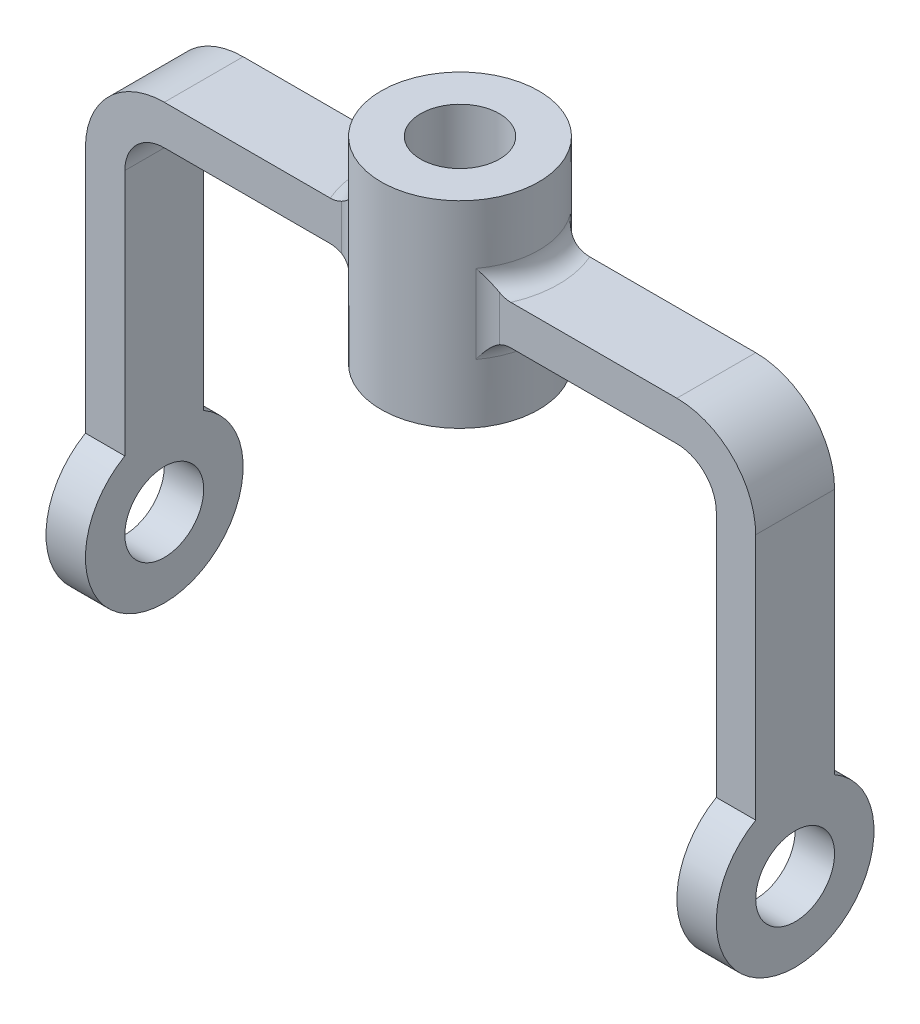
ISO-10303-21;
HEADER;
FILE_DESCRIPTION(('STEP AP214'),'2;1');
FILE_NAME('part.step','',(''),(''),'','','');
FILE_SCHEMA(('AUTOMOTIVE_DESIGN { 1 0 10303 214 1 1 1 1 }'));
ENDSEC;
DATA;
#1=APPLICATION_CONTEXT('core data for automotive mechanical design processes');
#2=APPLICATION_PROTOCOL_DEFINITION('international standard','automotive_design',2000,#1);
#3=PRODUCT_CONTEXT('',#1,'mechanical');
#4=PRODUCT('Part','Part','',(#3));
#5=PRODUCT_RELATED_PRODUCT_CATEGORY('part','',(#4));
#6=PRODUCT_DEFINITION_FORMATION('','',#4);
#7=PRODUCT_DEFINITION_CONTEXT('part definition',#1,'design');
#8=PRODUCT_DEFINITION('design','',#6,#7);
#9=PRODUCT_DEFINITION_SHAPE('','',#8);
#10=(LENGTH_UNIT() NAMED_UNIT(*) SI_UNIT(.MILLI.,.METRE.));
#11=(NAMED_UNIT(*) PLANE_ANGLE_UNIT() SI_UNIT($,.RADIAN.));
#12=(NAMED_UNIT(*) SI_UNIT($,.STERADIAN.) SOLID_ANGLE_UNIT());
#13=UNCERTAINTY_MEASURE_WITH_UNIT(LENGTH_MEASURE(1.E-05),#10,'distance_accuracy_value','');
#14=(GEOMETRIC_REPRESENTATION_CONTEXT(3) GLOBAL_UNCERTAINTY_ASSIGNED_CONTEXT((#13)) GLOBAL_UNIT_ASSIGNED_CONTEXT((#10,
#11,#12)) REPRESENTATION_CONTEXT('',''));
#15=CARTESIAN_POINT('',(0.,0.,0.));
#16=DIRECTION('',(0.,0.,1.));
#17=DIRECTION('',(1.,0.,0.));
#18=AXIS2_PLACEMENT_3D('',#15,#16,#17);
#19=CARTESIAN_POINT('',(65.,80.,10.));
#20=DIRECTION('',(0.,0.,1.));
#21=DIRECTION('',(1.,0.,0.));
#22=AXIS2_PLACEMENT_3D('',#19,#20,#21);
#23=PLANE('',#22);
#24=CARTESIAN_POINT('',(22.9128784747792,100.,10.));
#25=CARTESIAN_POINT('',(22.7439714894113,99.9999921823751,10.));
#26=CARTESIAN_POINT('',(22.5750758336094,100.007189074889,10.));
#27=CARTESIAN_POINT('',(22.2385001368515,100.035777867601,10.));
#28=CARTESIAN_POINT('',(22.0708200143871,100.057168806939,10.));
#29=CARTESIAN_POINT('',(21.7377129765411,100.113953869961,10.));
#30=CARTESIAN_POINT('',(21.5722879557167,100.149359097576,10.));
#31=CARTESIAN_POINT('',(21.244933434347,100.233926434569,10.));
#32=CARTESIAN_POINT('',(21.0830051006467,100.283093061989,10.));
#33=CARTESIAN_POINT('',(20.763819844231,100.394906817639,10.));
#34=CARTESIAN_POINT('',(20.6065641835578,100.457557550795,10.));
#35=CARTESIAN_POINT('',(20.2979553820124,100.596012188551,10.));
#36=CARTESIAN_POINT('',(20.1466020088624,100.671815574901,10.));
#37=CARTESIAN_POINT('',(19.8509953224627,100.836231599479,10.));
#38=CARTESIAN_POINT('',(19.706742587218,100.924845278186,10.));
#39=CARTESIAN_POINT('',(19.4266841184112,101.114434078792,10.));
#40=CARTESIAN_POINT('',(19.2908745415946,101.2154035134,10.));
#41=CARTESIAN_POINT('',(19.0322189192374,101.426610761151,10.));
#42=CARTESIAN_POINT('',(18.9091350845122,101.536557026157,10.));
#43=CARTESIAN_POINT('',(18.6735826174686,101.767195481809,10.));
#44=CARTESIAN_POINT('',(18.5611085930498,101.887882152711,10.));
#45=CARTESIAN_POINT('',(18.3480853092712,102.139386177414,10.));
#46=CARTESIAN_POINT('',(18.2475365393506,102.270203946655,10.));
#47=CARTESIAN_POINT('',(18.0598146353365,102.541105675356,10.));
#48=CARTESIAN_POINT('',(17.9726389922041,102.681187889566,10.));
#49=CARTESIAN_POINT('',(17.8215782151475,102.954194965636,10.));
#50=CARTESIAN_POINT('',(17.7562018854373,103.086295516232,10.));
#51=CARTESIAN_POINT('',(17.6382445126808,103.356081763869,10.));
#52=CARTESIAN_POINT('',(17.5856609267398,103.493766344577,10.));
#53=CARTESIAN_POINT('',(17.494260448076,103.773276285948,10.));
#54=CARTESIAN_POINT('',(17.4554113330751,103.915091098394,10.));
#55=CARTESIAN_POINT('',(17.3920312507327,104.201811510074,10.));
#56=CARTESIAN_POINT('',(17.3674900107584,104.346714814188,10.));
#57=CARTESIAN_POINT('',(17.3403995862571,104.576713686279,10.));
#58=CARTESIAN_POINT('',(17.3329404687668,104.661258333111,10.));
#59=CARTESIAN_POINT('',(17.3229962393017,104.830530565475,10.));
#60=CARTESIAN_POINT('',(17.32050475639,104.915257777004,10.));
#61=CARTESIAN_POINT('',(17.3205080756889,105.,10.));
#62=B_SPLINE_CURVE_WITH_KNOTS('',3,(#24,#25,#26,#27,#28,#29,#30,#31,#32,#33,#34,#35,#36,#37,#38,
#39,#40,#41,#42,#43,#44,#45,#46,#47,#48,#49,#50,#51,#52,#53,#54,#55,#56,#57,#58,#59,#60,#61),
.UNSPECIFIED.,.F.,.F.,(4,2,2,2,2,2,2,2,2,2,2,2,2,2,2,2,2,2,4),(0.,0.506551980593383,
1.01306967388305,1.51998950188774,2.02707595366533,2.53429814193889,3.04150034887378,
3.54874377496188,4.05575459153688,4.55020602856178,5.04440480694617,5.53862386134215,
6.0327500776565,6.4743015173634,6.91576511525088,7.35618601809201,7.79629032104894,
8.05077753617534,8.30493816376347),.UNSPECIFIED.);
#63=CARTESIAN_POINT('',(22.9128784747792,100.,10.));
#64=VERTEX_POINT('',#63);
#65=CARTESIAN_POINT('',(20.,100.753355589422,10.));
#66=VERTEX_POINT('',#65);
#67=EDGE_CURVE('E429',#64,#66,#62,.T.);
#68=ORIENTED_EDGE('',*,*,#67,.T.);
#69=DIRECTION('',(0.,1.,0.));
#70=VECTOR('',#69,1.);
#71=CARTESIAN_POINT('',(20.,80.,10.));
#72=LINE('',#71,#70);
#73=CARTESIAN_POINT('',(20.,89.2466444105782,10.));
#74=VERTEX_POINT('',#73);
#75=EDGE_CURVE('E481',#66,#74,#72,.F.);
#76=ORIENTED_EDGE('',*,*,#75,.T.);
#77=CARTESIAN_POINT('',(17.3205080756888,85.,10.));
#78=CARTESIAN_POINT('',(17.3204781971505,85.1281731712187,10.));
#79=CARTESIAN_POINT('',(17.3261977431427,85.2563349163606,10.));
#80=CARTESIAN_POINT('',(17.3489127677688,85.5116053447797,10.));
#81=CARTESIAN_POINT('',(17.365903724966,85.6387144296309,10.));
#82=CARTESIAN_POINT('',(17.4108334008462,85.8903623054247,10.));
#83=CARTESIAN_POINT('',(17.4387204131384,86.0149103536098,10.));
#84=CARTESIAN_POINT('',(17.5050421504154,86.2611656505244,10.));
#85=CARTESIAN_POINT('',(17.5434775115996,86.3828727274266,10.));
#86=CARTESIAN_POINT('',(17.6303309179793,86.6224660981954,10.));
#87=CARTESIAN_POINT('',(17.6787340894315,86.740357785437,10.));
#88=CARTESIAN_POINT('',(17.7849692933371,86.9718308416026,10.));
#89=CARTESIAN_POINT('',(17.8428048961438,87.085410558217,10.));
#90=CARTESIAN_POINT('',(18.0295975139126,87.4188608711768,10.));
#91=CARTESIAN_POINT('',(18.1718390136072,87.6314390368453,10.));
#92=CARTESIAN_POINT('',(18.4957580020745,88.045173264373,10.));
#93=CARTESIAN_POINT('',(18.679307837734,88.2448482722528,10.));
#94=CARTESIAN_POINT('',(19.0739483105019,88.6147729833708,10.));
#95=CARTESIAN_POINT('',(19.2850476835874,88.7850133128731,10.));
#96=CARTESIAN_POINT('',(19.7569536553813,89.1132306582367,10.));
#97=CARTESIAN_POINT('',(20.0206755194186,89.2670199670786,10.));
#98=CARTESIAN_POINT('',(20.568577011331,89.5323901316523,10.));
#99=CARTESIAN_POINT('',(20.8527659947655,89.6439515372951,10.));
#100=CARTESIAN_POINT('',(21.4299948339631,89.8214938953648,10.));
#101=CARTESIAN_POINT('',(21.7228103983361,89.8881985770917,10.));
#102=CARTESIAN_POINT('',(22.1666749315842,89.9551335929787,10.));
#103=CARTESIAN_POINT('',(22.3153945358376,89.9719249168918,10.));
#104=CARTESIAN_POINT('',(22.6136816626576,89.9943561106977,10.));
#105=CARTESIAN_POINT('',(22.7632492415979,89.9999952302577,10.));
#106=CARTESIAN_POINT('',(22.9128784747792,90.,10.));
#107=B_SPLINE_CURVE_WITH_KNOTS('',3,(#77,#78,#79,#80,#81,#82,#83,#84,#85,#86,#87,#88,#89,#90,
#91,#92,#93,#94,#95,#96,#97,#98,#99,#100,#101,#102,#103,#104,#105,#106),.UNSPECIFIED.,.F.,.F.,
(4,2,2,2,2,2,2,2,2,2,2,2,2,2,4),(0.,0.384374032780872,0.768593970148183,1.15101234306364,
1.53345378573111,1.91532863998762,2.29734837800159,3.06139921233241,3.87192002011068,
4.68269847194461,5.59474712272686,6.50721535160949,7.40458376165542,7.85321586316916,
8.30187814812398),.UNSPECIFIED.);
#108=CARTESIAN_POINT('',(22.9128784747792,90.,10.));
#109=VERTEX_POINT('',#108);
#110=EDGE_CURVE('E443',#74,#109,#107,.T.);
#111=ORIENTED_EDGE('',*,*,#110,.T.);
#112=DIRECTION('',(1.,0.,0.));
#113=VECTOR('',#112,1.);
#114=CARTESIAN_POINT('',(-64.9999999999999,90.,10.));
#115=LINE('',#114,#113);
#116=CARTESIAN_POINT('',(64.9999999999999,90.,10.));
#117=VERTEX_POINT('',#116);
#118=EDGE_CURVE('E268',#109,#117,#115,.T.);
#119=ORIENTED_EDGE('',*,*,#118,.T.);
#120=CARTESIAN_POINT('',(65.,80.,10.));
#121=DIRECTION('',(0.,0.,-1.));
#122=DIRECTION('',(-1.,0.,0.));
#123=AXIS2_PLACEMENT_3D('',#120,#121,#122);
#124=CIRCLE('',#123,9.99999999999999);
#125=CARTESIAN_POINT('',(75.,79.9999999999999,10.));
#126=VERTEX_POINT('',#125);
#127=EDGE_CURVE('E272',#117,#126,#124,.T.);
#128=ORIENTED_EDGE('',*,*,#127,.T.);
#129=DIRECTION('',(0.,-1.,0.));
#130=VECTOR('',#129,1.);
#131=CARTESIAN_POINT('',(75.,79.9999999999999,10.));
#132=LINE('',#131,#130);
#133=CARTESIAN_POINT('',(75.,17.3205080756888,10.));
#134=VERTEX_POINT('',#133);
#135=EDGE_CURVE('E246',#126,#134,#132,.T.);
#136=ORIENTED_EDGE('',*,*,#135,.T.);
#137=DIRECTION('',(1.,0.,0.));
#138=VECTOR('',#137,1.);
#139=CARTESIAN_POINT('',(75.,17.3205080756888,10.));
#140=LINE('',#139,#138);
#141=CARTESIAN_POINT('',(85.,17.3205080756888,10.));
#142=VERTEX_POINT('',#141);
#143=EDGE_CURVE('E240',#142,#134,#140,.F.);
#144=ORIENTED_EDGE('',*,*,#143,.F.);
#145=DIRECTION('',(0.,-1.,0.));
#146=VECTOR('',#145,1.);
#147=CARTESIAN_POINT('',(85.,79.9999999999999,10.));
#148=LINE('',#147,#146);
#149=CARTESIAN_POINT('',(85.,79.9999999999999,10.));
#150=VERTEX_POINT('',#149);
#151=EDGE_CURVE('E248',#150,#142,#148,.T.);
#152=ORIENTED_EDGE('',*,*,#151,.F.);
#153=CARTESIAN_POINT('',(65.,80.,10.));
#154=DIRECTION('',(0.,0.,1.));
#155=DIRECTION('',(1.,0.,0.));
#156=AXIS2_PLACEMENT_3D('',#153,#154,#155);
#157=CIRCLE('',#156,20.);
#158=CARTESIAN_POINT('',(64.9999999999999,100.,10.));
#159=VERTEX_POINT('',#158);
#160=EDGE_CURVE('E252',#159,#150,#157,.F.);
#161=ORIENTED_EDGE('',*,*,#160,.F.);
#162=DIRECTION('',(1.,0.,0.));
#163=VECTOR('',#162,1.);
#164=CARTESIAN_POINT('',(-64.9999999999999,100.,10.));
#165=LINE('',#164,#163);
#166=EDGE_CURVE('E255',#64,#159,#165,.T.);
#167=ORIENTED_EDGE('',*,*,#166,.F.);
#168=EDGE_LOOP('',(#68,#76,#111,#119,#128,#136,#144,#152,#161,#167));
#169=FACE_BOUND('',#168,.T.);
#170=ADVANCED_FACE('F33',(#169),#23,.T.);
#171=CARTESIAN_POINT('',(65.,80.,-10.));
#172=DIRECTION('',(0.,0.,1.));
#173=DIRECTION('',(1.,0.,0.));
#174=AXIS2_PLACEMENT_3D('',#171,#172,#173);
#175=PLANE('',#174);
#176=CARTESIAN_POINT('',(22.9128784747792,90.,-10.));
#177=CARTESIAN_POINT('',(22.7439714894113,90.0000078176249,-10.));
#178=CARTESIAN_POINT('',(22.5750758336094,89.9928109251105,-10.));
#179=CARTESIAN_POINT('',(22.2385001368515,89.9642221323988,-10.));
#180=CARTESIAN_POINT('',(22.0708200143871,89.9428311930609,-10.));
#181=CARTESIAN_POINT('',(21.7377129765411,89.8860461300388,-10.));
#182=CARTESIAN_POINT('',(21.5722879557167,89.8506409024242,-10.));
#183=CARTESIAN_POINT('',(21.244933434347,89.7660735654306,-10.));
#184=CARTESIAN_POINT('',(21.0830051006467,89.7169069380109,-10.));
#185=CARTESIAN_POINT('',(20.763819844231,89.6050931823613,-10.));
#186=CARTESIAN_POINT('',(20.6065641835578,89.5424424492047,-10.));
#187=CARTESIAN_POINT('',(20.2979553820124,89.4039878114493,-10.));
#188=CARTESIAN_POINT('',(20.1466020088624,89.3281844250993,-10.));
#189=CARTESIAN_POINT('',(19.8509953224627,89.1637684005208,-10.));
#190=CARTESIAN_POINT('',(19.706742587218,89.0751547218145,-10.));
#191=CARTESIAN_POINT('',(19.4266841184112,88.8855659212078,-10.));
#192=CARTESIAN_POINT('',(19.2908745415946,88.7845964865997,-10.));
#193=CARTESIAN_POINT('',(19.0322189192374,88.5733892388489,-10.));
#194=CARTESIAN_POINT('',(18.9091350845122,88.463442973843,-10.));
#195=CARTESIAN_POINT('',(18.6735826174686,88.2328045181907,-10.));
#196=CARTESIAN_POINT('',(18.5611085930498,88.1121178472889,-10.));
#197=CARTESIAN_POINT('',(18.3480853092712,87.8606138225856,-10.));
#198=CARTESIAN_POINT('',(18.2475365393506,87.7297960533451,-10.));
#199=CARTESIAN_POINT('',(18.0598146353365,87.4588943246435,-10.));
#200=CARTESIAN_POINT('',(17.9726389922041,87.3188121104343,-10.));
#201=CARTESIAN_POINT('',(17.8215782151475,87.0458050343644,-10.));
#202=CARTESIAN_POINT('',(17.7562018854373,86.9137044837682,-10.));
#203=CARTESIAN_POINT('',(17.6382445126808,86.6439182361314,-10.));
#204=CARTESIAN_POINT('',(17.5856609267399,86.5062336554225,-10.));
#205=CARTESIAN_POINT('',(17.494260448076,86.2267237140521,-10.));
#206=CARTESIAN_POINT('',(17.4554113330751,86.0849089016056,-10.));
#207=CARTESIAN_POINT('',(17.3920312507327,85.7981884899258,-10.));
#208=CARTESIAN_POINT('',(17.3674900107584,85.6532851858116,-10.));
#209=CARTESIAN_POINT('',(17.3403995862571,85.4232863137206,-10.));
#210=CARTESIAN_POINT('',(17.3329404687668,85.3387416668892,-10.));
#211=CARTESIAN_POINT('',(17.3229962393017,85.1694694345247,-10.));
#212=CARTESIAN_POINT('',(17.32050475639,85.0847422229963,-10.));
#213=CARTESIAN_POINT('',(17.3205080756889,85.,-10.));
#214=B_SPLINE_CURVE_WITH_KNOTS('',3,(#176,#177,#178,#179,#180,#181,#182,#183,#184,#185,#186,
#187,#188,#189,#190,#191,#192,#193,#194,#195,#196,#197,#198,#199,#200,#201,#202,#203,#204,#205,
#206,#207,#208,#209,#210,#211,#212,#213),.UNSPECIFIED.,.F.,.F.,(4,2,2,2,2,2,2,2,2,2,2,2,2,2,2,2,
2,2,4),(0.,0.506551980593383,1.01306967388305,1.51998950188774,2.02707595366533,
2.53429814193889,3.04150034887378,3.54874377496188,4.05575459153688,4.55020602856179,
5.04440480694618,5.53862386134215,6.0327500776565,6.4743015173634,6.91576511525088,
7.35618601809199,7.79629032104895,8.05077753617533,8.30493816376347),.UNSPECIFIED.);
#215=CARTESIAN_POINT('',(22.9128784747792,90.,-10.));
#216=VERTEX_POINT('',#215);
#217=CARTESIAN_POINT('',(20.,89.2466444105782,-10.));
#218=VERTEX_POINT('',#217);
#219=EDGE_CURVE('E449',#216,#218,#214,.T.);
#220=ORIENTED_EDGE('',*,*,#219,.T.);
#221=DIRECTION('',(0.,-1.,0.));
#222=VECTOR('',#221,1.);
#223=CARTESIAN_POINT('',(20.,105.,-10.));
#224=LINE('',#223,#222);
#225=CARTESIAN_POINT('',(20.,100.753355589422,-10.));
#226=VERTEX_POINT('',#225);
#227=EDGE_CURVE('E483',#218,#226,#224,.F.);
#228=ORIENTED_EDGE('',*,*,#227,.T.);
#229=CARTESIAN_POINT('',(17.3205080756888,105.,-10.));
#230=CARTESIAN_POINT('',(17.3204781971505,104.871826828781,-10.));
#231=CARTESIAN_POINT('',(17.3261977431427,104.743665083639,-10.));
#232=CARTESIAN_POINT('',(17.3489127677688,104.48839465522,-10.));
#233=CARTESIAN_POINT('',(17.365903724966,104.361285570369,-10.));
#234=CARTESIAN_POINT('',(17.4108334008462,104.109637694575,-10.));
#235=CARTESIAN_POINT('',(17.4387204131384,103.98508964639,-10.));
#236=CARTESIAN_POINT('',(17.5050421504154,103.738834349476,-10.));
#237=CARTESIAN_POINT('',(17.5434775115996,103.617127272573,-10.));
#238=CARTESIAN_POINT('',(17.6303309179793,103.377533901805,-10.));
#239=CARTESIAN_POINT('',(17.6787340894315,103.259642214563,-10.));
#240=CARTESIAN_POINT('',(17.7849692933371,103.028169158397,-10.));
#241=CARTESIAN_POINT('',(17.8428048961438,102.914589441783,-10.));
#242=CARTESIAN_POINT('',(18.0295975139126,102.581139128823,-10.));
#243=CARTESIAN_POINT('',(18.1718390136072,102.368560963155,-10.));
#244=CARTESIAN_POINT('',(18.4957580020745,101.954826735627,-10.));
#245=CARTESIAN_POINT('',(18.679307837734,101.755151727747,-10.));
#246=CARTESIAN_POINT('',(19.0739483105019,101.385227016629,-10.));
#247=CARTESIAN_POINT('',(19.2850476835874,101.214986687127,-10.));
#248=CARTESIAN_POINT('',(19.7569536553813,100.886769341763,-10.));
#249=CARTESIAN_POINT('',(20.0206755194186,100.732980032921,-10.));
#250=CARTESIAN_POINT('',(20.568577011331,100.467609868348,-10.));
#251=CARTESIAN_POINT('',(20.8527659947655,100.356048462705,-10.));
#252=CARTESIAN_POINT('',(21.4299948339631,100.178506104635,-10.));
#253=CARTESIAN_POINT('',(21.7228103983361,100.111801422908,-10.));
#254=CARTESIAN_POINT('',(22.1666749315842,100.044866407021,-10.));
#255=CARTESIAN_POINT('',(22.3153945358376,100.028075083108,-10.));
#256=CARTESIAN_POINT('',(22.6136816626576,100.005643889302,-10.));
#257=CARTESIAN_POINT('',(22.7632492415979,100.000004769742,-10.));
#258=CARTESIAN_POINT('',(22.9128784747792,100.,-10.));
#259=B_SPLINE_CURVE_WITH_KNOTS('',3,(#229,#230,#231,#232,#233,#234,#235,#236,#237,#238,#239,
#240,#241,#242,#243,#244,#245,#246,#247,#248,#249,#250,#251,#252,#253,#254,#255,#256,#257,#258),
.UNSPECIFIED.,.F.,.F.,(4,2,2,2,2,2,2,2,2,2,2,2,2,2,4),(0.,0.384374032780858,0.768593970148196,
1.15101234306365,1.53345378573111,1.91532863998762,2.29734837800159,3.06139921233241,
3.87192002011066,4.68269847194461,5.59474712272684,6.50721535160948,7.40458376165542,
7.85321586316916,8.30187814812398),.UNSPECIFIED.);
#260=CARTESIAN_POINT('',(22.9128784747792,100.,-10.));
#261=VERTEX_POINT('',#260);
#262=EDGE_CURVE('E437',#226,#261,#259,.T.);
#263=ORIENTED_EDGE('',*,*,#262,.T.);
#264=DIRECTION('',(1.,0.,0.));
#265=VECTOR('',#264,1.);
#266=CARTESIAN_POINT('',(-64.9999999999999,100.,-10.));
#267=LINE('',#266,#265);
#268=CARTESIAN_POINT('',(64.9999999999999,100.,-10.));
#269=VERTEX_POINT('',#268);
#270=EDGE_CURVE('E282',#261,#269,#267,.T.);
#271=ORIENTED_EDGE('',*,*,#270,.T.);
#272=CARTESIAN_POINT('',(65.,80.,-10.));
#273=DIRECTION('',(0.,0.,1.));
#274=DIRECTION('',(1.,0.,0.));
#275=AXIS2_PLACEMENT_3D('',#272,#273,#274);
#276=CIRCLE('',#275,20.);
#277=CARTESIAN_POINT('',(85.,79.9999999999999,-10.));
#278=VERTEX_POINT('',#277);
#279=EDGE_CURVE('E279',#269,#278,#276,.F.);
#280=ORIENTED_EDGE('',*,*,#279,.T.);
#281=DIRECTION('',(0.,-1.,0.));
#282=VECTOR('',#281,1.);
#283=CARTESIAN_POINT('',(85.,79.9999999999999,-10.));
#284=LINE('',#283,#282);
#285=CARTESIAN_POINT('',(85.,17.3205080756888,-10.));
#286=VERTEX_POINT('',#285);
#287=EDGE_CURVE('E277',#278,#286,#284,.T.);
#288=ORIENTED_EDGE('',*,*,#287,.T.);
#289=DIRECTION('',(1.,0.,0.));
#290=VECTOR('',#289,1.);
#291=CARTESIAN_POINT('',(75.,17.3205080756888,-10.));
#292=LINE('',#291,#290);
#293=CARTESIAN_POINT('',(75.,17.3205080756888,-10.));
#294=VERTEX_POINT('',#293);
#295=EDGE_CURVE('E222',#286,#294,#292,.F.);
#296=ORIENTED_EDGE('',*,*,#295,.T.);
#297=DIRECTION('',(0.,-1.,0.));
#298=VECTOR('',#297,1.);
#299=CARTESIAN_POINT('',(75.,79.9999999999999,-10.));
#300=LINE('',#299,#298);
#301=CARTESIAN_POINT('',(75.,79.9999999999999,-10.));
#302=VERTEX_POINT('',#301);
#303=EDGE_CURVE('E245',#302,#294,#300,.T.);
#304=ORIENTED_EDGE('',*,*,#303,.F.);
#305=CARTESIAN_POINT('',(65.,80.,-10.));
#306=DIRECTION('',(0.,0.,-1.));
#307=DIRECTION('',(-1.,0.,0.));
#308=AXIS2_PLACEMENT_3D('',#305,#306,#307);
#309=CIRCLE('',#308,9.99999999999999);
#310=CARTESIAN_POINT('',(64.9999999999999,90.,-10.));
#311=VERTEX_POINT('',#310);
#312=EDGE_CURVE('E249',#311,#302,#309,.T.);
#313=ORIENTED_EDGE('',*,*,#312,.F.);
#314=DIRECTION('',(1.,0.,0.));
#315=VECTOR('',#314,1.);
#316=CARTESIAN_POINT('',(-64.9999999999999,90.,-10.));
#317=LINE('',#316,#315);
#318=EDGE_CURVE('E290',#216,#311,#317,.T.);
#319=ORIENTED_EDGE('',*,*,#318,.F.);
#320=EDGE_LOOP('',(#220,#228,#263,#271,#280,#288,#296,#304,#313,#319));
#321=FACE_BOUND('',#320,.T.);
#322=ADVANCED_FACE('F354',(#321),#175,.F.);
#323=CARTESIAN_POINT('',(75.,79.9999999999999,10.));
#324=DIRECTION('',(1.,0.,0.));
#325=DIRECTION('',(0.,1.,0.));
#326=AXIS2_PLACEMENT_3D('',#323,#324,#325);
#327=PLANE('',#326);
#328=CARTESIAN_POINT('',(75.,0.,0.));
#329=DIRECTION('',(1.,0.,0.));
#330=DIRECTION('',(0.,1.,0.));
#331=AXIS2_PLACEMENT_3D('',#328,#329,#330);
#332=CIRCLE('',#331,10.);
#333=CARTESIAN_POINT('',(75.,10.,0.));
#334=VERTEX_POINT('',#333);
#335=EDGE_CURVE('E228',#334,#334,#332,.T.);
#336=ORIENTED_EDGE('',*,*,#335,.T.);
#337=EDGE_LOOP('',(#336));
#338=FACE_BOUND('',#337,.T.);
#339=ORIENTED_EDGE('',*,*,#303,.T.);
#340=CARTESIAN_POINT('',(75.,0.,0.));
#341=DIRECTION('',(1.,0.,0.));
#342=DIRECTION('',(0.,1.,0.));
#343=AXIS2_PLACEMENT_3D('',#340,#341,#342);
#344=CIRCLE('',#343,20.);
#345=EDGE_CURVE('E237',#134,#294,#344,.T.);
#346=ORIENTED_EDGE('',*,*,#345,.F.);
#347=ORIENTED_EDGE('',*,*,#135,.F.);
#348=DIRECTION('',(0.,0.,-1.));
#349=VECTOR('',#348,1.);
#350=CARTESIAN_POINT('',(75.,79.9999999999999,10.));
#351=LINE('',#350,#349);
#352=EDGE_CURVE('E274',#126,#302,#351,.T.);
#353=ORIENTED_EDGE('',*,*,#352,.T.);
#354=EDGE_LOOP('',(#339,#346,#347,#353));
#355=FACE_BOUND('',#354,.T.);
#356=ADVANCED_FACE('F364',(#338,#355),#327,.F.);
#357=CARTESIAN_POINT('',(85.,79.9999999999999,10.));
#358=DIRECTION('',(1.,0.,0.));
#359=DIRECTION('',(0.,1.,0.));
#360=AXIS2_PLACEMENT_3D('',#357,#358,#359);
#361=PLANE('',#360);
#362=CARTESIAN_POINT('',(85.,0.,0.));
#363=DIRECTION('',(1.,0.,0.));
#364=DIRECTION('',(0.,1.,0.));
#365=AXIS2_PLACEMENT_3D('',#362,#363,#364);
#366=CIRCLE('',#365,10.);
#367=CARTESIAN_POINT('',(85.,10.,0.));
#368=VERTEX_POINT('',#367);
#369=EDGE_CURVE('E596',#368,#368,#366,.T.);
#370=ORIENTED_EDGE('',*,*,#369,.F.);
#371=EDGE_LOOP('',(#370));
#372=FACE_BOUND('',#371,.T.);
#373=ORIENTED_EDGE('',*,*,#151,.T.);
#374=CARTESIAN_POINT('',(85.,0.,0.));
#375=DIRECTION('',(1.,0.,0.));
#376=DIRECTION('',(0.,1.,0.));
#377=AXIS2_PLACEMENT_3D('',#374,#375,#376);
#378=CIRCLE('',#377,20.);
#379=EDGE_CURVE('E236',#142,#286,#378,.T.);
#380=ORIENTED_EDGE('',*,*,#379,.T.);
#381=ORIENTED_EDGE('',*,*,#287,.F.);
#382=DIRECTION('',(0.,0.,-1.));
#383=VECTOR('',#382,1.);
#384=CARTESIAN_POINT('',(85.,79.9999999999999,10.));
#385=LINE('',#384,#383);
#386=EDGE_CURVE('E312',#150,#278,#385,.T.);
#387=ORIENTED_EDGE('',*,*,#386,.F.);
#388=EDGE_LOOP('',(#373,#380,#381,#387));
#389=FACE_BOUND('',#388,.T.);
#390=ADVANCED_FACE('F529',(#372,#389),#361,.T.);
#391=CARTESIAN_POINT('',(65.,80.,10.));
#392=DIRECTION('',(0.,0.,-1.));
#393=DIRECTION('',(-1.,0.,0.));
#394=AXIS2_PLACEMENT_3D('',#391,#392,#393);
#395=CYLINDRICAL_SURFACE('',#394,20.);
#396=ORIENTED_EDGE('',*,*,#279,.F.);
#397=DIRECTION('',(0.,0.,-1.));
#398=VECTOR('',#397,1.);
#399=CARTESIAN_POINT('',(64.9999999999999,100.,10.));
#400=LINE('',#399,#398);
#401=EDGE_CURVE('E309',#159,#269,#400,.T.);
#402=ORIENTED_EDGE('',*,*,#401,.F.);
#403=ORIENTED_EDGE('',*,*,#160,.T.);
#404=ORIENTED_EDGE('',*,*,#386,.T.);
#405=EDGE_LOOP('',(#396,#402,#403,#404));
#406=FACE_BOUND('',#405,.T.);
#407=ADVANCED_FACE('F521',(#406),#395,.T.);
#408=CARTESIAN_POINT('',(-64.9999999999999,100.,10.));
#409=DIRECTION('',(0.,1.,0.));
#410=DIRECTION('',(0.,0.,1.));
#411=AXIS2_PLACEMENT_3D('',#408,#409,#410);
#412=PLANE('',#411);
#413=ORIENTED_EDGE('',*,*,#270,.F.);
#414=CARTESIAN_POINT('',(0.,100.,0.));
#415=DIRECTION('',(0.,1.,0.));
#416=DIRECTION('',(0.,0.,1.));
#417=AXIS2_PLACEMENT_3D('',#414,#415,#416);
#418=CIRCLE('',#417,25.);
#419=EDGE_CURVE('E335',#261,#64,#418,.F.);
#420=ORIENTED_EDGE('',*,*,#419,.T.);
#421=ORIENTED_EDGE('',*,*,#166,.T.);
#422=ORIENTED_EDGE('',*,*,#401,.T.);
#423=EDGE_LOOP('',(#413,#420,#421,#422));
#424=FACE_BOUND('',#423,.T.);
#425=ADVANCED_FACE('F515',(#424),#412,.T.);
#426=CARTESIAN_POINT('',(-64.9999999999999,90.,10.));
#427=DIRECTION('',(0.,1.,0.));
#428=DIRECTION('',(0.,0.,1.));
#429=AXIS2_PLACEMENT_3D('',#426,#427,#428);
#430=PLANE('',#429);
#431=ORIENTED_EDGE('',*,*,#118,.F.);
#432=CARTESIAN_POINT('',(0.,90.,0.));
#433=DIRECTION('',(0.,1.,0.));
#434=DIRECTION('',(0.,0.,1.));
#435=AXIS2_PLACEMENT_3D('',#432,#433,#434);
#436=CIRCLE('',#435,25.);
#437=EDGE_CURVE('E338',#109,#216,#436,.T.);
#438=ORIENTED_EDGE('',*,*,#437,.T.);
#439=ORIENTED_EDGE('',*,*,#318,.T.);
#440=DIRECTION('',(0.,0.,-1.));
#441=VECTOR('',#440,1.);
#442=CARTESIAN_POINT('',(64.9999999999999,90.,10.));
#443=LINE('',#442,#441);
#444=EDGE_CURVE('E297',#117,#311,#443,.T.);
#445=ORIENTED_EDGE('',*,*,#444,.F.);
#446=EDGE_LOOP('',(#431,#438,#439,#445));
#447=FACE_BOUND('',#446,.T.);
#448=ADVANCED_FACE('F541',(#447),#430,.F.);
#449=CARTESIAN_POINT('',(65.,80.,10.));
#450=DIRECTION('',(0.,0.,-1.));
#451=DIRECTION('',(-1.,0.,0.));
#452=AXIS2_PLACEMENT_3D('',#449,#450,#451);
#453=CYLINDRICAL_SURFACE('',#452,9.99999999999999);
#454=ORIENTED_EDGE('',*,*,#312,.T.);
#455=ORIENTED_EDGE('',*,*,#352,.F.);
#456=ORIENTED_EDGE('',*,*,#127,.F.);
#457=ORIENTED_EDGE('',*,*,#444,.T.);
#458=EDGE_LOOP('',(#454,#455,#456,#457));
#459=FACE_BOUND('',#458,.T.);
#460=ADVANCED_FACE('F536',(#459),#453,.F.);
#461=CARTESIAN_POINT('',(75.,0.,0.));
#462=DIRECTION('',(1.,0.,0.));
#463=DIRECTION('',(0.,1.,0.));
#464=AXIS2_PLACEMENT_3D('',#461,#462,#463);
#465=CYLINDRICAL_SURFACE('',#464,20.);
#466=ORIENTED_EDGE('',*,*,#379,.F.);
#467=ORIENTED_EDGE('',*,*,#143,.T.);
#468=ORIENTED_EDGE('',*,*,#345,.T.);
#469=ORIENTED_EDGE('',*,*,#295,.F.);
#470=EDGE_LOOP('',(#466,#467,#468,#469));
#471=FACE_BOUND('',#470,.T.);
#472=ADVANCED_FACE('F460',(#471),#465,.T.);
#473=CARTESIAN_POINT('',(-85.,0.,0.));
#474=DIRECTION('',(1.,0.,0.));
#475=DIRECTION('',(0.,1.,0.));
#476=AXIS2_PLACEMENT_3D('',#473,#474,#475);
#477=CYLINDRICAL_SURFACE('',#476,10.);
#478=ORIENTED_EDGE('',*,*,#369,.T.);
#479=EDGE_LOOP('',(#478));
#480=FACE_BOUND('',#479,.T.);
#481=ORIENTED_EDGE('',*,*,#335,.F.);
#482=EDGE_LOOP('',(#481));
#483=FACE_BOUND('',#482,.T.);
#484=ADVANCED_FACE('F605',(#480,#483),#477,.F.);
#485=CARTESIAN_POINT('',(0.,120.,0.));
#486=DIRECTION('',(0.,-1.,0.));
#487=DIRECTION('',(1.,0.,0.));
#488=AXIS2_PLACEMENT_3D('',#485,#486,#487);
#489=PLANE('',#488);
#490=CARTESIAN_POINT('',(0.,120.,0.));
#491=DIRECTION('',(0.,1.,0.));
#492=DIRECTION('',(-1.,0.,0.));
#493=AXIS2_PLACEMENT_3D('',#490,#491,#492);
#494=CIRCLE('',#493,10.);
#495=CARTESIAN_POINT('',(-10.,120.,0.));
#496=VERTEX_POINT('',#495);
#497=EDGE_CURVE('E322',#496,#496,#494,.T.);
#498=ORIENTED_EDGE('',*,*,#497,.F.);
#499=EDGE_LOOP('',(#498));
#500=FACE_BOUND('',#499,.T.);
#501=CARTESIAN_POINT('',(0.,120.,0.));
#502=DIRECTION('',(0.,1.,0.));
#503=DIRECTION('',(-1.,0.,0.));
#504=AXIS2_PLACEMENT_3D('',#501,#502,#503);
#505=CIRCLE('',#504,20.);
#506=CARTESIAN_POINT('',(-20.,120.,0.));
#507=VERTEX_POINT('',#506);
#508=EDGE_CURVE('E591',#507,#507,#505,.T.);
#509=ORIENTED_EDGE('',*,*,#508,.T.);
#510=EDGE_LOOP('',(#509));
#511=FACE_BOUND('',#510,.T.);
#512=ADVANCED_FACE('F585',(#500,#511),#489,.F.);
#513=CARTESIAN_POINT('',(0.,120.,0.));
#514=DIRECTION('',(0.,1.,0.));
#515=DIRECTION('',(-1.,0.,0.));
#516=AXIS2_PLACEMENT_3D('',#513,#514,#515);
#517=CYLINDRICAL_SURFACE('',#516,20.);
#518=DIRECTION('',(0.,1.,0.));
#519=VECTOR('',#518,1.);
#520=CARTESIAN_POINT('',(-16.,120.,-12.));
#521=LINE('',#520,#519);
#522=CARTESIAN_POINT('',(-16.,85.,-12.));
#523=VERTEX_POINT('',#522);
#524=CARTESIAN_POINT('',(-16.,105.,-12.));
#525=VERTEX_POINT('',#524);
#526=EDGE_CURVE('E489',#523,#525,#521,.T.);
#527=ORIENTED_EDGE('',*,*,#526,.T.);
#528=CARTESIAN_POINT('',(0.,105.,0.));
#529=DIRECTION('',(0.,1.,0.));
#530=DIRECTION('',(0.,0.,1.));
#531=AXIS2_PLACEMENT_3D('',#528,#529,#530);
#532=CIRCLE('',#531,20.);
#533=CARTESIAN_POINT('',(-16.,105.,12.));
#534=VERTEX_POINT('',#533);
#535=EDGE_CURVE('E326',#525,#534,#532,.T.);
#536=ORIENTED_EDGE('',*,*,#535,.T.);
#537=DIRECTION('',(0.,1.,0.));
#538=VECTOR('',#537,1.);
#539=CARTESIAN_POINT('',(-16.,120.,12.));
#540=LINE('',#539,#538);
#541=CARTESIAN_POINT('',(-16.,85.,12.));
#542=VERTEX_POINT('',#541);
#543=EDGE_CURVE('E497',#534,#542,#540,.F.);
#544=ORIENTED_EDGE('',*,*,#543,.T.);
#545=CARTESIAN_POINT('',(0.,85.,0.));
#546=DIRECTION('',(0.,1.,0.));
#547=DIRECTION('',(0.,0.,1.));
#548=AXIS2_PLACEMENT_3D('',#545,#546,#547);
#549=CIRCLE('',#548,20.);
#550=EDGE_CURVE('E328',#542,#523,#549,.F.);
#551=ORIENTED_EDGE('',*,*,#550,.T.);
#552=EDGE_LOOP('',(#527,#536,#544,#551));
#553=FACE_BOUND('',#552,.T.);
#554=DIRECTION('',(0.,1.,0.));
#555=VECTOR('',#554,1.);
#556=CARTESIAN_POINT('',(16.,120.,-12.));
#557=LINE('',#556,#555);
#558=CARTESIAN_POINT('',(16.,105.,-12.));
#559=VERTEX_POINT('',#558);
#560=CARTESIAN_POINT('',(16.,85.,-12.));
#561=VERTEX_POINT('',#560);
#562=EDGE_CURVE('E492',#559,#561,#557,.F.);
#563=ORIENTED_EDGE('',*,*,#562,.T.);
#564=CARTESIAN_POINT('',(0.,85.,0.));
#565=DIRECTION('',(0.,1.,0.));
#566=DIRECTION('',(0.,0.,1.));
#567=AXIS2_PLACEMENT_3D('',#564,#565,#566);
#568=CIRCLE('',#567,20.);
#569=CARTESIAN_POINT('',(16.,85.,12.));
#570=VERTEX_POINT('',#569);
#571=EDGE_CURVE('E221',#561,#570,#568,.F.);
#572=ORIENTED_EDGE('',*,*,#571,.T.);
#573=DIRECTION('',(0.,1.,0.));
#574=VECTOR('',#573,1.);
#575=CARTESIAN_POINT('',(16.,120.,12.));
#576=LINE('',#575,#574);
#577=CARTESIAN_POINT('',(16.,105.,12.));
#578=VERTEX_POINT('',#577);
#579=EDGE_CURVE('E495',#570,#578,#576,.T.);
#580=ORIENTED_EDGE('',*,*,#579,.T.);
#581=CARTESIAN_POINT('',(0.,105.,0.));
#582=DIRECTION('',(0.,1.,0.));
#583=DIRECTION('',(0.,0.,1.));
#584=AXIS2_PLACEMENT_3D('',#581,#582,#583);
#585=CIRCLE('',#584,20.);
#586=EDGE_CURVE('E324',#578,#559,#585,.T.);
#587=ORIENTED_EDGE('',*,*,#586,.T.);
#588=EDGE_LOOP('',(#563,#572,#580,#587));
#589=FACE_BOUND('',#588,.T.);
#590=ORIENTED_EDGE('',*,*,#508,.F.);
#591=EDGE_LOOP('',(#590));
#592=FACE_BOUND('',#591,.T.);
#593=CARTESIAN_POINT('',(0.,70.,0.));
#594=DIRECTION('',(0.,1.,0.));
#595=DIRECTION('',(-1.,0.,0.));
#596=AXIS2_PLACEMENT_3D('',#593,#594,#595);
#597=CIRCLE('',#596,20.);
#598=CARTESIAN_POINT('',(-20.,70.,0.));
#599=VERTEX_POINT('',#598);
#600=EDGE_CURVE('E321',#599,#599,#597,.T.);
#601=ORIENTED_EDGE('',*,*,#600,.T.);
#602=EDGE_LOOP('',(#601));
#603=FACE_BOUND('',#602,.T.);
#604=ADVANCED_FACE('F581',(#553,#589,#592,#603),#517,.T.);
#605=CARTESIAN_POINT('',(20.,70.,0.));
#606=DIRECTION('',(0.,1.,0.));
#607=DIRECTION('',(-1.,0.,0.));
#608=AXIS2_PLACEMENT_3D('',#605,#606,#607);
#609=PLANE('',#608);
#610=CARTESIAN_POINT('',(0.,70.,0.));
#611=DIRECTION('',(0.,1.,0.));
#612=DIRECTION('',(-1.,0.,0.));
#613=AXIS2_PLACEMENT_3D('',#610,#611,#612);
#614=CIRCLE('',#613,10.);
#615=CARTESIAN_POINT('',(-10.,70.,0.));
#616=VERTEX_POINT('',#615);
#617=EDGE_CURVE('E318',#616,#616,#614,.T.);
#618=ORIENTED_EDGE('',*,*,#617,.T.);
#619=EDGE_LOOP('',(#618));
#620=FACE_BOUND('',#619,.T.);
#621=ORIENTED_EDGE('',*,*,#600,.F.);
#622=EDGE_LOOP('',(#621));
#623=FACE_BOUND('',#622,.T.);
#624=ADVANCED_FACE('F584',(#620,#623),#609,.F.);
#625=CARTESIAN_POINT('',(-85.,0.,0.));
#626=DIRECTION('',(1.,0.,0.));
#627=DIRECTION('',(0.,1.,0.));
#628=AXIS2_PLACEMENT_3D('',#625,#626,#627);
#629=CIRCLE('',#628,10.);
#630=CARTESIAN_POINT('',(-85.,9.99999999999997,0.));
#631=VERTEX_POINT('',#630);
#632=EDGE_CURVE('E317',#631,#631,#629,.T.);
#633=ORIENTED_EDGE('',*,*,#632,.F.);
#634=EDGE_LOOP('',(#633));
#635=FACE_BOUND('',#634,.T.);
#636=CARTESIAN_POINT('',(-75.,0.,0.));
#637=DIRECTION('',(-1.,0.,0.));
#638=DIRECTION('',(0.,0.,1.));
#639=AXIS2_PLACEMENT_3D('',#636,#637,#638);
#640=CIRCLE('',#639,10.);
#641=CARTESIAN_POINT('',(-75.,0.,10.));
#642=VERTEX_POINT('',#641);
#643=EDGE_CURVE('E232',#642,#642,#640,.T.);
#644=ORIENTED_EDGE('',*,*,#643,.F.);
#645=EDGE_LOOP('',(#644));
#646=FACE_BOUND('',#645,.T.);
#647=ADVANCED_FACE('F622',(#635,#646),#477,.F.);
#648=CARTESIAN_POINT('',(-85.,0.,10.));
#649=DIRECTION('',(-1.,0.,0.));
#650=DIRECTION('',(0.,0.,1.));
#651=AXIS2_PLACEMENT_3D('',#648,#649,#650);
#652=PLANE('',#651);
#653=ORIENTED_EDGE('',*,*,#632,.T.);
#654=EDGE_LOOP('',(#653));
#655=FACE_BOUND('',#654,.T.);
#656=DIRECTION('',(0.,1.,0.));
#657=VECTOR('',#656,1.);
#658=CARTESIAN_POINT('',(-85.,0.,-10.));
#659=LINE('',#658,#657);
#660=CARTESIAN_POINT('',(-85.,17.3205080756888,-10.));
#661=VERTEX_POINT('',#660);
#662=CARTESIAN_POINT('',(-85.,79.9999999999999,-10.));
#663=VERTEX_POINT('',#662);
#664=EDGE_CURVE('E200',#661,#663,#659,.T.);
#665=ORIENTED_EDGE('',*,*,#664,.F.);
#666=CARTESIAN_POINT('',(-85.,0.,0.));
#667=DIRECTION('',(1.,0.,0.));
#668=DIRECTION('',(0.,1.,0.));
#669=AXIS2_PLACEMENT_3D('',#666,#667,#668);
#670=CIRCLE('',#669,20.);
#671=CARTESIAN_POINT('',(-85.,17.3205080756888,10.));
#672=VERTEX_POINT('',#671);
#673=EDGE_CURVE('E204',#672,#661,#670,.T.);
#674=ORIENTED_EDGE('',*,*,#673,.F.);
#675=DIRECTION('',(0.,1.,0.));
#676=VECTOR('',#675,1.);
#677=CARTESIAN_POINT('',(-85.,0.,10.));
#678=LINE('',#677,#676);
#679=CARTESIAN_POINT('',(-85.,79.9999999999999,10.));
#680=VERTEX_POINT('',#679);
#681=EDGE_CURVE('E262',#672,#680,#678,.T.);
#682=ORIENTED_EDGE('',*,*,#681,.T.);
#683=DIRECTION('',(0.,0.,-1.));
#684=VECTOR('',#683,1.);
#685=CARTESIAN_POINT('',(-85.,79.9999999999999,10.));
#686=LINE('',#685,#684);
#687=EDGE_CURVE('E206',#680,#663,#686,.T.);
#688=ORIENTED_EDGE('',*,*,#687,.T.);
#689=EDGE_LOOP('',(#665,#674,#682,#688));
#690=FACE_BOUND('',#689,.T.);
#691=ADVANCED_FACE('F202',(#655,#690),#652,.T.);
#692=CARTESIAN_POINT('',(-75.,0.,0.));
#693=DIRECTION('',(-1.,0.,0.));
#694=DIRECTION('',(0.,-1.,0.));
#695=AXIS2_PLACEMENT_3D('',#692,#693,#694);
#696=CYLINDRICAL_SURFACE('',#695,20.);
#697=DIRECTION('',(-1.,0.,0.));
#698=VECTOR('',#697,1.);
#699=CARTESIAN_POINT('',(-75.,17.3205080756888,10.));
#700=LINE('',#699,#698);
#701=CARTESIAN_POINT('',(-75.,17.3205080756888,10.));
#702=VERTEX_POINT('',#701);
#703=EDGE_CURVE('E226',#672,#702,#700,.F.);
#704=ORIENTED_EDGE('',*,*,#703,.F.);
#705=ORIENTED_EDGE('',*,*,#673,.T.);
#706=DIRECTION('',(-1.,0.,0.));
#707=VECTOR('',#706,1.);
#708=CARTESIAN_POINT('',(-75.,17.3205080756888,-10.));
#709=LINE('',#708,#707);
#710=CARTESIAN_POINT('',(-75.,17.3205080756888,-10.));
#711=VERTEX_POINT('',#710);
#712=EDGE_CURVE('E214',#661,#711,#709,.F.);
#713=ORIENTED_EDGE('',*,*,#712,.T.);
#714=CARTESIAN_POINT('',(-75.,0.,0.));
#715=DIRECTION('',(1.,0.,0.));
#716=DIRECTION('',(0.,1.,0.));
#717=AXIS2_PLACEMENT_3D('',#714,#715,#716);
#718=CIRCLE('',#717,20.);
#719=EDGE_CURVE('E227',#702,#711,#718,.T.);
#720=ORIENTED_EDGE('',*,*,#719,.F.);
#721=EDGE_LOOP('',(#704,#705,#713,#720));
#722=FACE_BOUND('',#721,.T.);
#723=ADVANCED_FACE('F225',(#722),#696,.T.);
#724=CARTESIAN_POINT('',(-75.,0.,10.));
#725=DIRECTION('',(-1.,0.,0.));
#726=DIRECTION('',(0.,0.,1.));
#727=AXIS2_PLACEMENT_3D('',#724,#725,#726);
#728=PLANE('',#727);
#729=ORIENTED_EDGE('',*,*,#643,.T.);
#730=EDGE_LOOP('',(#729));
#731=FACE_BOUND('',#730,.T.);
#732=DIRECTION('',(0.,1.,0.));
#733=VECTOR('',#732,1.);
#734=CARTESIAN_POINT('',(-75.,0.,10.));
#735=LINE('',#734,#733);
#736=CARTESIAN_POINT('',(-75.,79.9999999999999,10.));
#737=VERTEX_POINT('',#736);
#738=EDGE_CURVE('E264',#702,#737,#735,.T.);
#739=ORIENTED_EDGE('',*,*,#738,.F.);
#740=ORIENTED_EDGE('',*,*,#719,.T.);
#741=DIRECTION('',(0.,1.,0.));
#742=VECTOR('',#741,1.);
#743=CARTESIAN_POINT('',(-75.,0.,-10.));
#744=LINE('',#743,#742);
#745=CARTESIAN_POINT('',(-75.,79.9999999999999,-10.));
#746=VERTEX_POINT('',#745);
#747=EDGE_CURVE('E210',#711,#746,#744,.T.);
#748=ORIENTED_EDGE('',*,*,#747,.T.);
#749=DIRECTION('',(0.,0.,-1.));
#750=VECTOR('',#749,1.);
#751=CARTESIAN_POINT('',(-75.,79.9999999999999,10.));
#752=LINE('',#751,#750);
#753=EDGE_CURVE('E303',#737,#746,#752,.T.);
#754=ORIENTED_EDGE('',*,*,#753,.F.);
#755=EDGE_LOOP('',(#739,#740,#748,#754));
#756=FACE_BOUND('',#755,.T.);
#757=ADVANCED_FACE('F570',(#731,#756),#728,.F.);
#758=CARTESIAN_POINT('',(-65.,80.,10.));
#759=DIRECTION('',(0.,0.,-1.));
#760=DIRECTION('',(-1.,0.,0.));
#761=AXIS2_PLACEMENT_3D('',#758,#759,#760);
#762=CYLINDRICAL_SURFACE('',#761,20.);
#763=CARTESIAN_POINT('',(-65.,80.,-10.));
#764=DIRECTION('',(0.,0.,1.));
#765=DIRECTION('',(1.,0.,0.));
#766=AXIS2_PLACEMENT_3D('',#763,#764,#765);
#767=CIRCLE('',#766,20.);
#768=CARTESIAN_POINT('',(-64.9999999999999,100.,-10.));
#769=VERTEX_POINT('',#768);
#770=EDGE_CURVE('E211',#663,#769,#767,.F.);
#771=ORIENTED_EDGE('',*,*,#770,.F.);
#772=ORIENTED_EDGE('',*,*,#687,.F.);
#773=CARTESIAN_POINT('',(-65.,80.,10.));
#774=DIRECTION('',(0.,0.,1.));
#775=DIRECTION('',(1.,0.,0.));
#776=AXIS2_PLACEMENT_3D('',#773,#774,#775);
#777=CIRCLE('',#776,20.);
#778=CARTESIAN_POINT('',(-64.9999999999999,100.,10.));
#779=VERTEX_POINT('',#778);
#780=EDGE_CURVE('E259',#680,#779,#777,.F.);
#781=ORIENTED_EDGE('',*,*,#780,.T.);
#782=DIRECTION('',(0.,0.,-1.));
#783=VECTOR('',#782,1.);
#784=CARTESIAN_POINT('',(-64.9999999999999,100.,10.));
#785=LINE('',#784,#783);
#786=EDGE_CURVE('E307',#779,#769,#785,.T.);
#787=ORIENTED_EDGE('',*,*,#786,.T.);
#788=EDGE_LOOP('',(#771,#772,#781,#787));
#789=FACE_BOUND('',#788,.T.);
#790=ADVANCED_FACE('F566',(#789),#762,.T.);
#791=CARTESIAN_POINT('',(-65.,80.,10.));
#792=DIRECTION('',(0.,0.,-1.));
#793=DIRECTION('',(-1.,0.,0.));
#794=AXIS2_PLACEMENT_3D('',#791,#792,#793);
#795=CYLINDRICAL_SURFACE('',#794,9.99999999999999);
#796=CARTESIAN_POINT('',(-65.,80.,-10.));
#797=DIRECTION('',(0.,0.,-1.));
#798=DIRECTION('',(-1.,0.,0.));
#799=AXIS2_PLACEMENT_3D('',#796,#797,#798);
#800=CIRCLE('',#799,9.99999999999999);
#801=CARTESIAN_POINT('',(-64.9999999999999,90.,-10.));
#802=VERTEX_POINT('',#801);
#803=EDGE_CURVE('E288',#746,#802,#800,.T.);
#804=ORIENTED_EDGE('',*,*,#803,.T.);
#805=DIRECTION('',(0.,0.,-1.));
#806=VECTOR('',#805,1.);
#807=CARTESIAN_POINT('',(-64.9999999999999,90.,10.));
#808=LINE('',#807,#806);
#809=CARTESIAN_POINT('',(-64.9999999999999,90.,10.));
#810=VERTEX_POINT('',#809);
#811=EDGE_CURVE('E300',#810,#802,#808,.T.);
#812=ORIENTED_EDGE('',*,*,#811,.F.);
#813=CARTESIAN_POINT('',(-65.,80.,10.));
#814=DIRECTION('',(0.,0.,-1.));
#815=DIRECTION('',(-1.,0.,0.));
#816=AXIS2_PLACEMENT_3D('',#813,#814,#815);
#817=CIRCLE('',#816,9.99999999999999);
#818=EDGE_CURVE('E266',#737,#810,#817,.T.);
#819=ORIENTED_EDGE('',*,*,#818,.F.);
#820=ORIENTED_EDGE('',*,*,#753,.T.);
#821=EDGE_LOOP('',(#804,#812,#819,#820));
#822=FACE_BOUND('',#821,.T.);
#823=ADVANCED_FACE('F574',(#822),#795,.F.);
#824=CARTESIAN_POINT('',(-22.9128784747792,100.,10.));
#825=VERTEX_POINT('',#824);
#826=EDGE_CURVE('E256',#779,#825,#165,.T.);
#827=ORIENTED_EDGE('',*,*,#826,.T.);
#828=CARTESIAN_POINT('',(0.,100.,0.));
#829=DIRECTION('',(0.,1.,0.));
#830=DIRECTION('',(0.,0.,1.));
#831=AXIS2_PLACEMENT_3D('',#828,#829,#830);
#832=CIRCLE('',#831,25.);
#833=CARTESIAN_POINT('',(-22.9128784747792,100.,-10.));
#834=VERTEX_POINT('',#833);
#835=EDGE_CURVE('E332',#825,#834,#832,.F.);
#836=ORIENTED_EDGE('',*,*,#835,.T.);
#837=EDGE_CURVE('E283',#769,#834,#267,.T.);
#838=ORIENTED_EDGE('',*,*,#837,.F.);
#839=ORIENTED_EDGE('',*,*,#786,.F.);
#840=EDGE_LOOP('',(#827,#836,#838,#839));
#841=FACE_BOUND('',#840,.T.);
#842=ADVANCED_FACE('F563',(#841),#412,.T.);
#843=CARTESIAN_POINT('',(-22.9128784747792,90.,-10.));
#844=VERTEX_POINT('',#843);
#845=EDGE_CURVE('E291',#802,#844,#317,.T.);
#846=ORIENTED_EDGE('',*,*,#845,.T.);
#847=CARTESIAN_POINT('',(0.,90.,0.));
#848=DIRECTION('',(0.,1.,0.));
#849=DIRECTION('',(0.,0.,1.));
#850=AXIS2_PLACEMENT_3D('',#847,#848,#849);
#851=CIRCLE('',#850,25.);
#852=CARTESIAN_POINT('',(-22.9128784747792,90.,10.));
#853=VERTEX_POINT('',#852);
#854=EDGE_CURVE('E330',#844,#853,#851,.T.);
#855=ORIENTED_EDGE('',*,*,#854,.T.);
#856=EDGE_CURVE('E269',#810,#853,#115,.T.);
#857=ORIENTED_EDGE('',*,*,#856,.F.);
#858=ORIENTED_EDGE('',*,*,#811,.T.);
#859=EDGE_LOOP('',(#846,#855,#857,#858));
#860=FACE_BOUND('',#859,.T.);
#861=ADVANCED_FACE('F577',(#860),#430,.F.);
#862=CARTESIAN_POINT('',(-22.9128784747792,100.,-10.));
#863=CARTESIAN_POINT('',(-22.7439714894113,99.9999921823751,-10.));
#864=CARTESIAN_POINT('',(-22.5750758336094,100.007189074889,-10.));
#865=CARTESIAN_POINT('',(-22.2385001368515,100.035777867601,-10.));
#866=CARTESIAN_POINT('',(-22.0708200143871,100.057168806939,-10.));
#867=CARTESIAN_POINT('',(-21.7377129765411,100.113953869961,-10.));
#868=CARTESIAN_POINT('',(-21.5722879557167,100.149359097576,-10.));
#869=CARTESIAN_POINT('',(-21.244933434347,100.233926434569,-10.));
#870=CARTESIAN_POINT('',(-21.0830051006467,100.283093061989,-10.));
#871=CARTESIAN_POINT('',(-20.763819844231,100.394906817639,-10.));
#872=CARTESIAN_POINT('',(-20.6065641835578,100.457557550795,-10.));
#873=CARTESIAN_POINT('',(-20.2979553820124,100.596012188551,-10.));
#874=CARTESIAN_POINT('',(-20.1466020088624,100.671815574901,-10.));
#875=CARTESIAN_POINT('',(-19.8509953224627,100.836231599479,-10.));
#876=CARTESIAN_POINT('',(-19.706742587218,100.924845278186,-10.));
#877=CARTESIAN_POINT('',(-19.4266841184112,101.114434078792,-10.));
#878=CARTESIAN_POINT('',(-19.2908745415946,101.2154035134,-10.));
#879=CARTESIAN_POINT('',(-19.0322189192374,101.426610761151,-10.));
#880=CARTESIAN_POINT('',(-18.9091350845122,101.536557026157,-10.));
#881=CARTESIAN_POINT('',(-18.6735826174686,101.767195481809,-10.));
#882=CARTESIAN_POINT('',(-18.5611085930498,101.887882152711,-10.));
#883=CARTESIAN_POINT('',(-18.3480853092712,102.139386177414,-10.));
#884=CARTESIAN_POINT('',(-18.2475365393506,102.270203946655,-10.));
#885=CARTESIAN_POINT('',(-18.0598146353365,102.541105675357,-10.));
#886=CARTESIAN_POINT('',(-17.9726389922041,102.681187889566,-10.));
#887=CARTESIAN_POINT('',(-17.8215782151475,102.954194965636,-10.));
#888=CARTESIAN_POINT('',(-17.7562018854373,103.086295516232,-10.));
#889=CARTESIAN_POINT('',(-17.6382445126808,103.356081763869,-10.));
#890=CARTESIAN_POINT('',(-17.5856609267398,103.493766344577,-10.));
#891=CARTESIAN_POINT('',(-17.494260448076,103.773276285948,-10.));
#892=CARTESIAN_POINT('',(-17.4554113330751,103.915091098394,-10.));
#893=CARTESIAN_POINT('',(-17.3920312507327,104.201811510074,-10.));
#894=CARTESIAN_POINT('',(-17.3674900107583,104.346714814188,-10.));
#895=CARTESIAN_POINT('',(-17.3403995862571,104.576713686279,-10.));
#896=CARTESIAN_POINT('',(-17.3329404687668,104.661258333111,-10.));
#897=CARTESIAN_POINT('',(-17.3229962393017,104.830530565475,-10.));
#898=CARTESIAN_POINT('',(-17.32050475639,104.915257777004,-10.));
#899=CARTESIAN_POINT('',(-17.3205080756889,105.,-10.));
#900=B_SPLINE_CURVE_WITH_KNOTS('',3,(#862,#863,#864,#865,#866,#867,#868,#869,#870,#871,#872,
#873,#874,#875,#876,#877,#878,#879,#880,#881,#882,#883,#884,#885,#886,#887,#888,#889,#890,#891,
#892,#893,#894,#895,#896,#897,#898,#899),.UNSPECIFIED.,.F.,.F.,(4,2,2,2,2,2,2,2,2,2,2,2,2,2,2,2,
2,2,4),(0.,0.506551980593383,1.01306967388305,1.51998950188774,2.02707595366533,2.5342981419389,
3.04150034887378,3.54874377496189,4.05575459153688,4.55020602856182,5.04440480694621,
5.5386238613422,6.03275007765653,6.47430151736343,6.91576511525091,7.35618601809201,
7.79629032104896,8.05077753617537,8.30493816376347),.UNSPECIFIED.);
#901=CARTESIAN_POINT('',(-20.,100.753355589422,-10.));
#902=VERTEX_POINT('',#901);
#903=EDGE_CURVE('E470',#834,#902,#900,.T.);
#904=ORIENTED_EDGE('',*,*,#903,.T.);
#905=DIRECTION('',(0.,-1.,0.));
#906=VECTOR('',#905,1.);
#907=CARTESIAN_POINT('',(-20.,85.,-10.));
#908=LINE('',#907,#906);
#909=CARTESIAN_POINT('',(-20.,89.2466444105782,-10.));
#910=VERTEX_POINT('',#909);
#911=EDGE_CURVE('E487',#902,#910,#908,.T.);
#912=ORIENTED_EDGE('',*,*,#911,.T.);
#913=CARTESIAN_POINT('',(-17.3205080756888,85.,-10.));
#914=CARTESIAN_POINT('',(-17.3204781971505,85.1281731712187,-10.));
#915=CARTESIAN_POINT('',(-17.3261977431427,85.2563349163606,-10.));
#916=CARTESIAN_POINT('',(-17.3489127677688,85.5116053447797,-10.));
#917=CARTESIAN_POINT('',(-17.365903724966,85.6387144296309,-10.));
#918=CARTESIAN_POINT('',(-17.4108334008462,85.8903623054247,-10.));
#919=CARTESIAN_POINT('',(-17.4387204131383,86.0149103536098,-10.));
#920=CARTESIAN_POINT('',(-17.5050421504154,86.2611656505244,-10.));
#921=CARTESIAN_POINT('',(-17.5434775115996,86.3828727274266,-10.));
#922=CARTESIAN_POINT('',(-17.6303309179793,86.6224660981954,-10.));
#923=CARTESIAN_POINT('',(-17.6787340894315,86.740357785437,-10.));
#924=CARTESIAN_POINT('',(-17.7849692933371,86.9718308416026,-10.));
#925=CARTESIAN_POINT('',(-17.8428048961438,87.085410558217,-10.));
#926=CARTESIAN_POINT('',(-18.0295975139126,87.4188608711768,-10.));
#927=CARTESIAN_POINT('',(-18.1718390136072,87.6314390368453,-10.));
#928=CARTESIAN_POINT('',(-18.4957580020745,88.045173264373,-10.));
#929=CARTESIAN_POINT('',(-18.679307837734,88.2448482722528,-10.));
#930=CARTESIAN_POINT('',(-19.0739483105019,88.6147729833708,-10.));
#931=CARTESIAN_POINT('',(-19.2850476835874,88.7850133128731,-10.));
#932=CARTESIAN_POINT('',(-19.7569536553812,89.1132306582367,-10.));
#933=CARTESIAN_POINT('',(-20.0206755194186,89.2670199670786,-10.));
#934=CARTESIAN_POINT('',(-20.568577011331,89.5323901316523,-10.));
#935=CARTESIAN_POINT('',(-20.8527659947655,89.6439515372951,-10.));
#936=CARTESIAN_POINT('',(-21.4299948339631,89.8214938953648,-10.));
#937=CARTESIAN_POINT('',(-21.7228103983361,89.8881985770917,-10.));
#938=CARTESIAN_POINT('',(-22.1666749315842,89.9551335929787,-10.));
#939=CARTESIAN_POINT('',(-22.3153945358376,89.9719249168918,-10.));
#940=CARTESIAN_POINT('',(-22.6136816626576,89.9943561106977,-10.));
#941=CARTESIAN_POINT('',(-22.7632492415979,89.9999952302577,-10.));
#942=CARTESIAN_POINT('',(-22.9128784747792,90.,-10.));
#943=B_SPLINE_CURVE_WITH_KNOTS('',3,(#913,#914,#915,#916,#917,#918,#919,#920,#921,#922,#923,
#924,#925,#926,#927,#928,#929,#930,#931,#932,#933,#934,#935,#936,#937,#938,#939,#940,#941,#942),
.UNSPECIFIED.,.F.,.F.,(4,2,2,2,2,2,2,2,2,2,2,2,2,2,4),(0.,0.384374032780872,0.768593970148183,
1.15101234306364,1.53345378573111,1.91532863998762,2.29734837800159,3.06139921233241,
3.87192002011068,4.68269847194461,5.59474712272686,6.50721535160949,7.40458376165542,
7.85321586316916,8.30187814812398),.UNSPECIFIED.);
#944=EDGE_CURVE('E340',#910,#844,#943,.T.);
#945=ORIENTED_EDGE('',*,*,#944,.T.);
#946=ORIENTED_EDGE('',*,*,#845,.F.);
#947=ORIENTED_EDGE('',*,*,#803,.F.);
#948=ORIENTED_EDGE('',*,*,#747,.F.);
#949=ORIENTED_EDGE('',*,*,#712,.F.);
#950=ORIENTED_EDGE('',*,*,#664,.T.);
#951=ORIENTED_EDGE('',*,*,#770,.T.);
#952=ORIENTED_EDGE('',*,*,#837,.T.);
#953=EDGE_LOOP('',(#904,#912,#945,#946,#947,#948,#949,#950,#951,#952));
#954=FACE_BOUND('',#953,.T.);
#955=ADVANCED_FACE('F216',(#954),#175,.F.);
#956=CARTESIAN_POINT('',(-22.9128784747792,90.,10.));
#957=CARTESIAN_POINT('',(-22.7439714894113,90.0000078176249,10.));
#958=CARTESIAN_POINT('',(-22.5750758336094,89.9928109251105,10.));
#959=CARTESIAN_POINT('',(-22.2385001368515,89.9642221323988,10.));
#960=CARTESIAN_POINT('',(-22.0708200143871,89.9428311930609,10.));
#961=CARTESIAN_POINT('',(-21.7377129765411,89.8860461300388,10.));
#962=CARTESIAN_POINT('',(-21.5722879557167,89.8506409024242,10.));
#963=CARTESIAN_POINT('',(-21.244933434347,89.7660735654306,10.));
#964=CARTESIAN_POINT('',(-21.0830051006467,89.7169069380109,10.));
#965=CARTESIAN_POINT('',(-20.763819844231,89.6050931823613,10.));
#966=CARTESIAN_POINT('',(-20.6065641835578,89.5424424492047,10.));
#967=CARTESIAN_POINT('',(-20.2979553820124,89.4039878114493,10.));
#968=CARTESIAN_POINT('',(-20.1466020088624,89.3281844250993,10.));
#969=CARTESIAN_POINT('',(-19.8509953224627,89.1637684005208,10.));
#970=CARTESIAN_POINT('',(-19.706742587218,89.0751547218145,10.));
#971=CARTESIAN_POINT('',(-19.4266841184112,88.8855659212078,10.));
#972=CARTESIAN_POINT('',(-19.2908745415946,88.7845964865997,10.));
#973=CARTESIAN_POINT('',(-19.0322189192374,88.5733892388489,10.));
#974=CARTESIAN_POINT('',(-18.9091350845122,88.463442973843,10.));
#975=CARTESIAN_POINT('',(-18.6735826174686,88.2328045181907,10.));
#976=CARTESIAN_POINT('',(-18.5611085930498,88.1121178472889,10.));
#977=CARTESIAN_POINT('',(-18.3480853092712,87.8606138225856,10.));
#978=CARTESIAN_POINT('',(-18.2475365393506,87.7297960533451,10.));
#979=CARTESIAN_POINT('',(-18.0598146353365,87.4588943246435,10.));
#980=CARTESIAN_POINT('',(-17.9726389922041,87.3188121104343,10.));
#981=CARTESIAN_POINT('',(-17.8215782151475,87.0458050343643,10.));
#982=CARTESIAN_POINT('',(-17.7562018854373,86.9137044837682,10.));
#983=CARTESIAN_POINT('',(-17.6382445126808,86.6439182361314,10.));
#984=CARTESIAN_POINT('',(-17.5856609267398,86.5062336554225,10.));
#985=CARTESIAN_POINT('',(-17.494260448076,86.2267237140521,10.));
#986=CARTESIAN_POINT('',(-17.4554113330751,86.0849089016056,10.));
#987=CARTESIAN_POINT('',(-17.3920312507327,85.7981884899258,10.));
#988=CARTESIAN_POINT('',(-17.3674900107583,85.6532851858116,10.));
#989=CARTESIAN_POINT('',(-17.3403995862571,85.4232863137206,10.));
#990=CARTESIAN_POINT('',(-17.3329404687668,85.3387416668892,10.));
#991=CARTESIAN_POINT('',(-17.3229962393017,85.1694694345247,10.));
#992=CARTESIAN_POINT('',(-17.32050475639,85.0847422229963,10.));
#993=CARTESIAN_POINT('',(-17.3205080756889,85.,10.));
#994=B_SPLINE_CURVE_WITH_KNOTS('',3,(#956,#957,#958,#959,#960,#961,#962,#963,#964,#965,#966,
#967,#968,#969,#970,#971,#972,#973,#974,#975,#976,#977,#978,#979,#980,#981,#982,#983,#984,#985,
#986,#987,#988,#989,#990,#991,#992,#993),.UNSPECIFIED.,.F.,.F.,(4,2,2,2,2,2,2,2,2,2,2,2,2,2,2,2,
2,2,4),(0.,0.506551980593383,1.01306967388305,1.51998950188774,2.02707595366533,2.5342981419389,
3.04150034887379,3.54874377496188,4.05575459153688,4.5502060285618,5.04440480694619,
5.53862386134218,6.03275007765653,6.47430151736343,6.9157651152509,7.35618601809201,
7.79629032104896,8.05077753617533,8.30493816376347),.UNSPECIFIED.);
#995=CARTESIAN_POINT('',(-20.,89.2466444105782,10.));
#996=VERTEX_POINT('',#995);
#997=EDGE_CURVE('E347',#853,#996,#994,.T.);
#998=ORIENTED_EDGE('',*,*,#997,.T.);
#999=DIRECTION('',(0.,1.,0.));
#1000=VECTOR('',#999,1.);
#1001=CARTESIAN_POINT('',(-20.,80.,10.));
#1002=LINE('',#1001,#1000);
#1003=CARTESIAN_POINT('',(-20.,100.753355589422,10.));
#1004=VERTEX_POINT('',#1003);
#1005=EDGE_CURVE('E477',#996,#1004,#1002,.T.);
#1006=ORIENTED_EDGE('',*,*,#1005,.T.);
#1007=CARTESIAN_POINT('',(-17.3205080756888,105.,10.));
#1008=CARTESIAN_POINT('',(-17.3204781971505,104.871826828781,10.));
#1009=CARTESIAN_POINT('',(-17.3261977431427,104.743665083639,10.));
#1010=CARTESIAN_POINT('',(-17.3489127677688,104.48839465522,10.));
#1011=CARTESIAN_POINT('',(-17.365903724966,104.361285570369,10.));
#1012=CARTESIAN_POINT('',(-17.4108334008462,104.109637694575,10.));
#1013=CARTESIAN_POINT('',(-17.4387204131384,103.98508964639,10.));
#1014=CARTESIAN_POINT('',(-17.5050421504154,103.738834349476,10.));
#1015=CARTESIAN_POINT('',(-17.5434775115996,103.617127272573,10.));
#1016=CARTESIAN_POINT('',(-17.6303309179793,103.377533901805,10.));
#1017=CARTESIAN_POINT('',(-17.6787340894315,103.259642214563,10.));
#1018=CARTESIAN_POINT('',(-17.7849692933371,103.028169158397,10.));
#1019=CARTESIAN_POINT('',(-17.8428048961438,102.914589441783,10.));
#1020=CARTESIAN_POINT('',(-18.0295975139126,102.581139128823,10.));
#1021=CARTESIAN_POINT('',(-18.1718390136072,102.368560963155,10.));
#1022=CARTESIAN_POINT('',(-18.4957580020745,101.954826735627,10.));
#1023=CARTESIAN_POINT('',(-18.679307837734,101.755151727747,10.));
#1024=CARTESIAN_POINT('',(-19.0739483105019,101.385227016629,10.));
#1025=CARTESIAN_POINT('',(-19.2850476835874,101.214986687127,10.));
#1026=CARTESIAN_POINT('',(-19.7569536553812,100.886769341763,10.));
#1027=CARTESIAN_POINT('',(-20.0206755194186,100.732980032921,10.));
#1028=CARTESIAN_POINT('',(-20.568577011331,100.467609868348,10.));
#1029=CARTESIAN_POINT('',(-20.8527659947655,100.356048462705,10.));
#1030=CARTESIAN_POINT('',(-21.4299948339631,100.178506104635,10.));
#1031=CARTESIAN_POINT('',(-21.7228103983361,100.111801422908,10.));
#1032=CARTESIAN_POINT('',(-22.1666749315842,100.044866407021,10.));
#1033=CARTESIAN_POINT('',(-22.3153945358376,100.028075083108,10.));
#1034=CARTESIAN_POINT('',(-22.6136816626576,100.005643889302,10.));
#1035=CARTESIAN_POINT('',(-22.7632492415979,100.000004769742,10.));
#1036=CARTESIAN_POINT('',(-22.9128784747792,100.,10.));
#1037=B_SPLINE_CURVE_WITH_KNOTS('',3,(#1007,#1008,#1009,#1010,#1011,#1012,#1013,#1014,#1015,
#1016,#1017,#1018,#1019,#1020,#1021,#1022,#1023,#1024,#1025,#1026,#1027,#1028,#1029,#1030,#1031,
#1032,#1033,#1034,#1035,#1036),.UNSPECIFIED.,.F.,.F.,(4,2,2,2,2,2,2,2,2,2,2,2,2,2,4),(0.,
0.384374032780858,0.768593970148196,1.15101234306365,1.53345378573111,1.91532863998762,
2.29734837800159,3.06139921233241,3.87192002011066,4.68269847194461,5.59474712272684,
6.50721535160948,7.40458376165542,7.85321586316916,8.30187814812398),.UNSPECIFIED.);
#1038=EDGE_CURVE('E465',#1004,#825,#1037,.T.);
#1039=ORIENTED_EDGE('',*,*,#1038,.T.);
#1040=ORIENTED_EDGE('',*,*,#826,.F.);
#1041=ORIENTED_EDGE('',*,*,#780,.F.);
#1042=ORIENTED_EDGE('',*,*,#681,.F.);
#1043=ORIENTED_EDGE('',*,*,#703,.T.);
#1044=ORIENTED_EDGE('',*,*,#738,.T.);
#1045=ORIENTED_EDGE('',*,*,#818,.T.);
#1046=ORIENTED_EDGE('',*,*,#856,.T.);
#1047=EDGE_LOOP('',(#998,#1006,#1039,#1040,#1041,#1042,#1043,#1044,#1045,#1046));
#1048=FACE_BOUND('',#1047,.T.);
#1049=ADVANCED_FACE('F459',(#1048),#23,.T.);
#1050=CARTESIAN_POINT('',(0.,-20.,0.));
#1051=DIRECTION('',(0.,1.,0.));
#1052=DIRECTION('',(-1.,0.,0.));
#1053=AXIS2_PLACEMENT_3D('',#1050,#1051,#1052);
#1054=CYLINDRICAL_SURFACE('',#1053,10.);
#1055=ORIENTED_EDGE('',*,*,#497,.T.);
#1056=EDGE_LOOP('',(#1055));
#1057=FACE_BOUND('',#1056,.T.);
#1058=ORIENTED_EDGE('',*,*,#617,.F.);
#1059=EDGE_LOOP('',(#1058));
#1060=FACE_BOUND('',#1059,.T.);
#1061=ADVANCED_FACE('F363',(#1057,#1060),#1054,.F.);
#1062=CARTESIAN_POINT('',(0.,85.,0.));
#1063=DIRECTION('',(0.,1.,0.));
#1064=DIRECTION('',(0.,0.,1.));
#1065=AXIS2_PLACEMENT_3D('',#1062,#1063,#1064);
#1066=TOROIDAL_SURFACE('',#1065,25.,5.);
#1067=ORIENTED_EDGE('',*,*,#997,.F.);
#1068=ORIENTED_EDGE('',*,*,#854,.F.);
#1069=ORIENTED_EDGE('',*,*,#944,.F.);
#1070=CARTESIAN_POINT('',(-20.,89.2466444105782,-10.));
#1071=CARTESIAN_POINT('',(-19.843268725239,89.1595156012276,-10.0000256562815));
#1072=CARTESIAN_POINT('',(-19.6898523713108,89.0668693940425,-10.0073660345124));
#1073=CARTESIAN_POINT('',(-19.390536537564,88.8725632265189,-10.0350079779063));
#1074=CARTESIAN_POINT('',(-19.2446201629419,88.7709250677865,-10.0552788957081));
#1075=CARTESIAN_POINT('',(-18.961608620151,88.5610895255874,-10.1069171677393));
#1076=CARTESIAN_POINT('',(-18.8244510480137,88.4529526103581,-10.1381923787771));
#1077=CARTESIAN_POINT('',(-18.5576661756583,88.2306820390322,-10.2105543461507));
#1078=CARTESIAN_POINT('',(-18.4280446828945,88.1165438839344,-10.2516485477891));
#1079=CARTESIAN_POINT('',(-18.1258204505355,87.8366820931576,-10.3607503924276));
#1080=CARTESIAN_POINT('',(-17.9568603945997,87.6686490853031,-10.4329388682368));
#1081=CARTESIAN_POINT('',(-17.6333769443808,87.3257559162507,-10.5918734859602));
#1082=CARTESIAN_POINT('',(-17.4788577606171,87.1508937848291,-10.6786238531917));
#1083=CARTESIAN_POINT('',(-17.1832824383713,86.7957727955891,-10.8651800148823));
#1084=CARTESIAN_POINT('',(-17.0422705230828,86.6154985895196,-10.9650263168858));
#1085=CARTESIAN_POINT('',(-16.7738560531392,86.2517556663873,-11.1762390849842));
#1086=CARTESIAN_POINT('',(-16.6464483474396,86.0682881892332,-11.2876011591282));
#1087=CARTESIAN_POINT('',(-16.4307856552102,85.7389916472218,-11.4959862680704));
#1088=CARTESIAN_POINT('',(-16.3399906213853,85.59352032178,-11.5909695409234));
#1089=CARTESIAN_POINT('',(-16.1666623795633,85.3022049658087,-11.7871160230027));
#1090=CARTESIAN_POINT('',(-16.0841164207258,85.1563618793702,-11.8882692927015));
#1091=CARTESIAN_POINT('',(-16.0037736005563,85.0070272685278,-11.9949734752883));
#1092=CARTESIAN_POINT('',(-16.0018856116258,85.0035136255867,-11.9974858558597));
#1093=CARTESIAN_POINT('',(-16.,85.,-12.));
#1094=B_SPLINE_CURVE_WITH_KNOTS('',3,(#1070,#1071,#1072,#1073,#1074,#1075,#1076,#1077,#1078,
#1079,#1080,#1081,#1082,#1083,#1084,#1085,#1086,#1087,#1088,#1089,#1090,#1091,#1092,#1093),
.UNSPECIFIED.,.F.,.F.,(4,2,2,2,2,2,2,2,2,2,2,4),(0.,0.537388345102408,1.07350770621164,
1.6052407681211,2.13737830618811,2.88320718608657,3.62925285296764,4.37766310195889,
5.12578896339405,5.713627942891,6.30054375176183,6.31468589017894),.UNSPECIFIED.);
#1095=EDGE_CURVE('E372',#910,#523,#1094,.T.);
#1096=ORIENTED_EDGE('',*,*,#1095,.T.);
#1097=ORIENTED_EDGE('',*,*,#550,.F.);
#1098=CARTESIAN_POINT('',(-20.,89.2466444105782,10.));
#1099=CARTESIAN_POINT('',(-19.843268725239,89.1595156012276,10.0000256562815));
#1100=CARTESIAN_POINT('',(-19.6898523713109,89.0668693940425,10.0073660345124));
#1101=CARTESIAN_POINT('',(-19.3905365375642,88.872563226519,10.0350079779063));
#1102=CARTESIAN_POINT('',(-19.2446201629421,88.7709250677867,10.0552788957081));
#1103=CARTESIAN_POINT('',(-18.9616086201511,88.5610895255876,10.1069171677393));
#1104=CARTESIAN_POINT('',(-18.8244510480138,88.4529526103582,10.1381923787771));
#1105=CARTESIAN_POINT('',(-18.5576661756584,88.2306820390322,10.2105543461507));
#1106=CARTESIAN_POINT('',(-18.4280446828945,88.1165438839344,10.2516485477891));
#1107=CARTESIAN_POINT('',(-18.1258204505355,87.8366820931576,10.3607503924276));
#1108=CARTESIAN_POINT('',(-17.9568603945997,87.6686490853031,10.4329388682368));
#1109=CARTESIAN_POINT('',(-17.6333769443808,87.3257559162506,10.5918734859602));
#1110=CARTESIAN_POINT('',(-17.4788577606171,87.1508937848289,10.6786238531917));
#1111=CARTESIAN_POINT('',(-17.1832824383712,86.795772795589,10.8651800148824));
#1112=CARTESIAN_POINT('',(-17.0422705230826,86.6154985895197,10.965026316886));
#1113=CARTESIAN_POINT('',(-16.7738560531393,86.2517556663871,11.1762390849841));
#1114=CARTESIAN_POINT('',(-16.64644834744,86.0682881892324,11.2876011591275));
#1115=CARTESIAN_POINT('',(-16.4307856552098,85.7389916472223,11.495986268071));
#1116=CARTESIAN_POINT('',(-16.339990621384,85.593520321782,11.5909695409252));
#1117=CARTESIAN_POINT('',(-16.1666623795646,85.3022049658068,11.7871160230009));
#1118=CARTESIAN_POINT('',(-16.0841164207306,85.156361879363,11.888269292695));
#1119=CARTESIAN_POINT('',(-16.0037736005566,85.0070272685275,11.994973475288));
#1120=CARTESIAN_POINT('',(-16.0018856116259,85.0035136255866,11.9974858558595));
#1121=CARTESIAN_POINT('',(-16.,85.,12.));
#1122=B_SPLINE_CURVE_WITH_KNOTS('',3,(#1098,#1099,#1100,#1101,#1102,#1103,#1104,#1105,#1106,
#1107,#1108,#1109,#1110,#1111,#1112,#1113,#1114,#1115,#1116,#1117,#1118,#1119,#1120,#1121),
.UNSPECIFIED.,.F.,.F.,(4,2,2,2,2,2,2,2,2,2,2,4),(0.,0.537388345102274,1.07350770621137,
1.60524076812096,2.13737830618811,2.88320718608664,3.62925285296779,4.37766310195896,
5.12578896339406,5.713627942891,6.30054375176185,6.31468589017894),.UNSPECIFIED.);
#1123=EDGE_CURVE('E11',#542,#996,#1122,.F.);
#1124=ORIENTED_EDGE('',*,*,#1123,.T.);
#1125=EDGE_LOOP('',(#1067,#1068,#1069,#1096,#1097,#1124));
#1126=FACE_BOUND('',#1125,.T.);
#1127=ADVANCED_FACE('F357',(#1126),#1066,.F.);
#1128=CARTESIAN_POINT('',(0.,105.,0.));
#1129=DIRECTION('',(0.,1.,0.));
#1130=DIRECTION('',(0.,0.,1.));
#1131=AXIS2_PLACEMENT_3D('',#1128,#1129,#1130);
#1132=TOROIDAL_SURFACE('',#1131,25.,5.);
#1133=ORIENTED_EDGE('',*,*,#1038,.F.);
#1134=CARTESIAN_POINT('',(-20.,100.753355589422,10.));
#1135=CARTESIAN_POINT('',(-19.8432687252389,100.840484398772,10.0000256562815));
#1136=CARTESIAN_POINT('',(-19.6898523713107,100.933130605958,10.0073660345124));
#1137=CARTESIAN_POINT('',(-19.3905365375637,101.127436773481,10.0350079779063));
#1138=CARTESIAN_POINT('',(-19.2446201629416,101.229074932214,10.0552788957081));
#1139=CARTESIAN_POINT('',(-18.9616086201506,101.438910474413,10.1069171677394));
#1140=CARTESIAN_POINT('',(-18.8244510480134,101.547047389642,10.1381923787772));
#1141=CARTESIAN_POINT('',(-18.5576661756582,101.769317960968,10.2105543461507));
#1142=CARTESIAN_POINT('',(-18.4280446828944,101.883456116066,10.2516485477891));
#1143=CARTESIAN_POINT('',(-18.1258204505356,102.163317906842,10.3607503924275));
#1144=CARTESIAN_POINT('',(-17.9568603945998,102.331350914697,10.4329388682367));
#1145=CARTESIAN_POINT('',(-17.6333769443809,102.674244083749,10.5918734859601));
#1146=CARTESIAN_POINT('',(-17.4788577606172,102.849106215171,10.6786238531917));
#1147=CARTESIAN_POINT('',(-17.1832824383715,103.204227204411,10.8651800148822));
#1148=CARTESIAN_POINT('',(-17.0422705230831,103.384501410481,10.9650263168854));
#1149=CARTESIAN_POINT('',(-16.773856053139,103.748244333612,11.1762390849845));
#1150=CARTESIAN_POINT('',(-16.6464483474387,103.931711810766,11.2876011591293));
#1151=CARTESIAN_POINT('',(-16.4307856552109,104.261008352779,11.4959862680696));
#1152=CARTESIAN_POINT('',(-16.3399906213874,104.406479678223,11.5909695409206));
#1153=CARTESIAN_POINT('',(-16.1666623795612,104.697795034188,11.7871160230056));
#1154=CARTESIAN_POINT('',(-16.0841164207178,104.843638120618,11.8882692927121));
#1155=CARTESIAN_POINT('',(-16.003773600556,104.992972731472,11.9949734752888));
#1156=CARTESIAN_POINT('',(-16.0018856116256,104.996486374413,11.99748585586));
#1157=CARTESIAN_POINT('',(-16.,105.,12.));
#1158=B_SPLINE_CURVE_WITH_KNOTS('',3,(#1134,#1135,#1136,#1137,#1138,#1139,#1140,#1141,#1142,
#1143,#1144,#1145,#1146,#1147,#1148,#1149,#1150,#1151,#1152,#1153,#1154,#1155,#1156,#1157),
.UNSPECIFIED.,.F.,.F.,(4,2,2,2,2,2,2,2,2,2,2,4),(0.,0.537388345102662,1.07350770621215,
1.60524076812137,2.13737830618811,2.88320718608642,3.62925285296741,4.37766310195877,
5.12578896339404,5.71362794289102,6.30054375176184,6.31468589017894),.UNSPECIFIED.);
#1159=EDGE_CURVE('E47',#1004,#534,#1158,.T.);
#1160=ORIENTED_EDGE('',*,*,#1159,.T.);
#1161=ORIENTED_EDGE('',*,*,#535,.F.);
#1162=CARTESIAN_POINT('',(-20.,100.753355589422,-10.));
#1163=CARTESIAN_POINT('',(-19.843268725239,100.840484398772,-10.0000256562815));
#1164=CARTESIAN_POINT('',(-19.6898523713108,100.933130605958,-10.0073660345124));
#1165=CARTESIAN_POINT('',(-19.3905365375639,101.127436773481,-10.0350079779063));
#1166=CARTESIAN_POINT('',(-19.2446201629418,101.229074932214,-10.0552788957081));
#1167=CARTESIAN_POINT('',(-18.9616086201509,101.438910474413,-10.1069171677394));
#1168=CARTESIAN_POINT('',(-18.8244510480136,101.547047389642,-10.1381923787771));
#1169=CARTESIAN_POINT('',(-18.5576661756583,101.769317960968,-10.2105543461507));
#1170=CARTESIAN_POINT('',(-18.4280446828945,101.883456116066,-10.2516485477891));
#1171=CARTESIAN_POINT('',(-18.1258204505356,102.163317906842,-10.3607503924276));
#1172=CARTESIAN_POINT('',(-17.9568603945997,102.331350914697,-10.4329388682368));
#1173=CARTESIAN_POINT('',(-17.6333769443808,102.674244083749,-10.5918734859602));
#1174=CARTESIAN_POINT('',(-17.4788577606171,102.849106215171,-10.6786238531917));
#1175=CARTESIAN_POINT('',(-17.1832824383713,103.204227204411,-10.8651800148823));
#1176=CARTESIAN_POINT('',(-17.0422705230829,103.38450141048,-10.9650263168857));
#1177=CARTESIAN_POINT('',(-16.7738560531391,103.748244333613,-11.1762390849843));
#1178=CARTESIAN_POINT('',(-16.6464483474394,103.931711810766,-11.2876011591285));
#1179=CARTESIAN_POINT('',(-16.4307856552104,104.261008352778,-11.4959862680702));
#1180=CARTESIAN_POINT('',(-16.3399906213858,104.406479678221,-11.5909695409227));
#1181=CARTESIAN_POINT('',(-16.1666623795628,104.69779503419,-11.7871160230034));
#1182=CARTESIAN_POINT('',(-16.0841164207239,104.843638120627,-11.8882692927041));
#1183=CARTESIAN_POINT('',(-16.0037736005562,104.992972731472,-11.9949734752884));
#1184=CARTESIAN_POINT('',(-16.0018856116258,104.996486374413,-11.9974858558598));
#1185=CARTESIAN_POINT('',(-16.,105.,-12.));
#1186=B_SPLINE_CURVE_WITH_KNOTS('',3,(#1162,#1163,#1164,#1165,#1166,#1167,#1168,#1169,#1170,
#1171,#1172,#1173,#1174,#1175,#1176,#1177,#1178,#1179,#1180,#1181,#1182,#1183,#1184,#1185),
.UNSPECIFIED.,.F.,.F.,(4,2,2,2,2,2,2,2,2,2,2,4),(0.,0.537388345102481,1.07350770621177,
1.60524076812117,2.13737830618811,2.88320718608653,3.62925285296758,4.37766310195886,
5.12578896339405,5.71362794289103,6.30054375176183,6.31468589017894),.UNSPECIFIED.);
#1187=EDGE_CURVE('E382',#525,#902,#1186,.F.);
#1188=ORIENTED_EDGE('',*,*,#1187,.T.);
#1189=ORIENTED_EDGE('',*,*,#903,.F.);
#1190=ORIENTED_EDGE('',*,*,#835,.F.);
#1191=EDGE_LOOP('',(#1133,#1160,#1161,#1188,#1189,#1190));
#1192=FACE_BOUND('',#1191,.T.);
#1193=ADVANCED_FACE('F362',(#1192),#1132,.F.);
#1194=CARTESIAN_POINT('',(0.,105.,0.));
#1195=DIRECTION('',(0.,1.,0.));
#1196=DIRECTION('',(0.,0.,1.));
#1197=AXIS2_PLACEMENT_3D('',#1194,#1195,#1196);
#1198=TOROIDAL_SURFACE('',#1197,25.,5.);
#1199=ORIENTED_EDGE('',*,*,#262,.F.);
#1200=CARTESIAN_POINT('',(20.,100.753355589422,-10.));
#1201=CARTESIAN_POINT('',(19.843268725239,100.840484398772,-10.0000256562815));
#1202=CARTESIAN_POINT('',(19.6898523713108,100.933130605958,-10.0073660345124));
#1203=CARTESIAN_POINT('',(19.390536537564,101.127436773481,-10.0350079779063));
#1204=CARTESIAN_POINT('',(19.2446201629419,101.229074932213,-10.0552788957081));
#1205=CARTESIAN_POINT('',(18.9616086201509,101.438910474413,-10.1069171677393));
#1206=CARTESIAN_POINT('',(18.8244510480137,101.547047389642,-10.1381923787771));
#1207=CARTESIAN_POINT('',(18.5576661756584,101.769317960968,-10.2105543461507));
#1208=CARTESIAN_POINT('',(18.4280446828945,101.883456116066,-10.2516485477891));
#1209=CARTESIAN_POINT('',(18.1258204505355,102.163317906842,-10.3607503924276));
#1210=CARTESIAN_POINT('',(17.9568603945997,102.331350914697,-10.4329388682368));
#1211=CARTESIAN_POINT('',(17.6333769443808,102.674244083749,-10.5918734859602));
#1212=CARTESIAN_POINT('',(17.4788577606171,102.849106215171,-10.6786238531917));
#1213=CARTESIAN_POINT('',(17.1832824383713,103.204227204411,-10.8651800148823));
#1214=CARTESIAN_POINT('',(17.0422705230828,103.38450141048,-10.9650263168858));
#1215=CARTESIAN_POINT('',(16.7738560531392,103.748244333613,-11.1762390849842));
#1216=CARTESIAN_POINT('',(16.6464483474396,103.931711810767,-11.2876011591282));
#1217=CARTESIAN_POINT('',(16.4307856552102,104.261008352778,-11.4959862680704));
#1218=CARTESIAN_POINT('',(16.3399906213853,104.40647967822,-11.5909695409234));
#1219=CARTESIAN_POINT('',(16.1666623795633,104.697795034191,-11.7871160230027));
#1220=CARTESIAN_POINT('',(16.0841164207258,104.84363812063,-11.8882692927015));
#1221=CARTESIAN_POINT('',(16.0037736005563,104.992972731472,-11.9949734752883));
#1222=CARTESIAN_POINT('',(16.0018856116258,104.996486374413,-11.9974858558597));
#1223=CARTESIAN_POINT('',(16.,105.,-12.));
#1224=B_SPLINE_CURVE_WITH_KNOTS('',3,(#1200,#1201,#1202,#1203,#1204,#1205,#1206,#1207,#1208,
#1209,#1210,#1211,#1212,#1213,#1214,#1215,#1216,#1217,#1218,#1219,#1220,#1221,#1222,#1223),
.UNSPECIFIED.,.F.,.F.,(4,2,2,2,2,2,2,2,2,2,2,4),(0.,0.537388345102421,1.07350770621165,
1.6052407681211,2.13737830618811,2.88320718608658,3.62925285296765,4.37766310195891,
5.12578896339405,5.713627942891,6.30054375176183,6.31468589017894),.UNSPECIFIED.);
#1225=EDGE_CURVE('E409',#226,#559,#1224,.T.);
#1226=ORIENTED_EDGE('',*,*,#1225,.T.);
#1227=ORIENTED_EDGE('',*,*,#586,.F.);
#1228=CARTESIAN_POINT('',(20.,100.753355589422,10.));
#1229=CARTESIAN_POINT('',(19.843268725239,100.840484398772,10.0000256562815));
#1230=CARTESIAN_POINT('',(19.6898523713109,100.933130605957,10.0073660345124));
#1231=CARTESIAN_POINT('',(19.3905365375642,101.127436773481,10.0350079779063));
#1232=CARTESIAN_POINT('',(19.2446201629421,101.229074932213,10.0552788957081));
#1233=CARTESIAN_POINT('',(18.9616086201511,101.438910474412,10.1069171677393));
#1234=CARTESIAN_POINT('',(18.8244510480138,101.547047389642,10.1381923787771));
#1235=CARTESIAN_POINT('',(18.5576661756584,101.769317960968,10.2105543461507));
#1236=CARTESIAN_POINT('',(18.4280446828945,101.883456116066,10.2516485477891));
#1237=CARTESIAN_POINT('',(18.1258204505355,102.163317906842,10.3607503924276));
#1238=CARTESIAN_POINT('',(17.9568603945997,102.331350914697,10.4329388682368));
#1239=CARTESIAN_POINT('',(17.6333769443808,102.674244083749,10.5918734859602));
#1240=CARTESIAN_POINT('',(17.4788577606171,102.849106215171,10.6786238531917));
#1241=CARTESIAN_POINT('',(17.1832824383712,103.204227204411,10.8651800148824));
#1242=CARTESIAN_POINT('',(17.0422705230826,103.38450141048,10.965026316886));
#1243=CARTESIAN_POINT('',(16.7738560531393,103.748244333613,11.1762390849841));
#1244=CARTESIAN_POINT('',(16.64644834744,103.931711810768,11.2876011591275));
#1245=CARTESIAN_POINT('',(16.4307856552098,104.261008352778,11.495986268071));
#1246=CARTESIAN_POINT('',(16.339990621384,104.406479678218,11.5909695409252));
#1247=CARTESIAN_POINT('',(16.1666623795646,104.697795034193,11.7871160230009));
#1248=CARTESIAN_POINT('',(16.0841164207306,104.843638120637,11.888269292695));
#1249=CARTESIAN_POINT('',(16.0037736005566,104.992972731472,11.994973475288));
#1250=CARTESIAN_POINT('',(16.0018856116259,104.996486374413,11.9974858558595));
#1251=CARTESIAN_POINT('',(16.,105.,12.));
#1252=B_SPLINE_CURVE_WITH_KNOTS('',3,(#1228,#1229,#1230,#1231,#1232,#1233,#1234,#1235,#1236,
#1237,#1238,#1239,#1240,#1241,#1242,#1243,#1244,#1245,#1246,#1247,#1248,#1249,#1250,#1251),
.UNSPECIFIED.,.F.,.F.,(4,2,2,2,2,2,2,2,2,2,2,4),(0.,0.537388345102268,1.07350770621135,
1.60524076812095,2.13737830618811,2.88320718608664,3.62925285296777,4.37766310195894,
5.12578896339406,5.71362794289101,6.30054375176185,6.31468589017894),.UNSPECIFIED.);
#1253=EDGE_CURVE('E548',#578,#66,#1252,.F.);
#1254=ORIENTED_EDGE('',*,*,#1253,.T.);
#1255=ORIENTED_EDGE('',*,*,#67,.F.);
#1256=ORIENTED_EDGE('',*,*,#419,.F.);
#1257=EDGE_LOOP('',(#1199,#1226,#1227,#1254,#1255,#1256));
#1258=FACE_BOUND('',#1257,.T.);
#1259=ADVANCED_FACE('F422',(#1258),#1198,.F.);
#1260=CARTESIAN_POINT('',(0.,85.,0.));
#1261=DIRECTION('',(0.,1.,0.));
#1262=DIRECTION('',(0.,0.,1.));
#1263=AXIS2_PLACEMENT_3D('',#1260,#1261,#1262);
#1264=TOROIDAL_SURFACE('',#1263,25.,5.);
#1265=ORIENTED_EDGE('',*,*,#219,.F.);
#1266=ORIENTED_EDGE('',*,*,#437,.F.);
#1267=ORIENTED_EDGE('',*,*,#110,.F.);
#1268=CARTESIAN_POINT('',(20.,89.2466444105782,10.));
#1269=CARTESIAN_POINT('',(19.8432687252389,89.1595156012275,10.0000256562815));
#1270=CARTESIAN_POINT('',(19.6898523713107,89.0668693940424,10.0073660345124));
#1271=CARTESIAN_POINT('',(19.3905365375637,88.8725632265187,10.0350079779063));
#1272=CARTESIAN_POINT('',(19.2446201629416,88.7709250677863,10.0552788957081));
#1273=CARTESIAN_POINT('',(18.9616086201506,88.5610895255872,10.1069171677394));
#1274=CARTESIAN_POINT('',(18.8244510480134,88.4529526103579,10.1381923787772));
#1275=CARTESIAN_POINT('',(18.5576661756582,88.2306820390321,10.2105543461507));
#1276=CARTESIAN_POINT('',(18.4280446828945,88.1165438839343,10.2516485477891));
#1277=CARTESIAN_POINT('',(18.1258204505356,87.8366820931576,10.3607503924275));
#1278=CARTESIAN_POINT('',(17.9568603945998,87.6686490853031,10.4329388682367));
#1279=CARTESIAN_POINT('',(17.6333769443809,87.3257559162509,10.5918734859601));
#1280=CARTESIAN_POINT('',(17.4788577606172,87.1508937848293,10.6786238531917));
#1281=CARTESIAN_POINT('',(17.1832824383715,86.7957727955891,10.8651800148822));
#1282=CARTESIAN_POINT('',(17.0422705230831,86.6154985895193,10.9650263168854));
#1283=CARTESIAN_POINT('',(16.773856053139,86.2517556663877,11.1762390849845));
#1284=CARTESIAN_POINT('',(16.6464483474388,86.0682881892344,11.2876011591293));
#1285=CARTESIAN_POINT('',(16.4307856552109,85.7389916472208,11.4959862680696));
#1286=CARTESIAN_POINT('',(16.3399906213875,85.5935203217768,11.5909695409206));
#1287=CARTESIAN_POINT('',(16.1666623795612,85.302204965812,11.7871160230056));
#1288=CARTESIAN_POINT('',(16.0841164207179,85.1563618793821,11.8882692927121));
#1289=CARTESIAN_POINT('',(16.003773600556,85.0070272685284,11.9949734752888));
#1290=CARTESIAN_POINT('',(16.0018856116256,85.003513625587,11.99748585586));
#1291=CARTESIAN_POINT('',(16.,85.,12.));
#1292=B_SPLINE_CURVE_WITH_KNOTS('',3,(#1268,#1269,#1270,#1271,#1272,#1273,#1274,#1275,#1276,
#1277,#1278,#1279,#1280,#1281,#1282,#1283,#1284,#1285,#1286,#1287,#1288,#1289,#1290,#1291),
.UNSPECIFIED.,.F.,.F.,(4,2,2,2,2,2,2,2,2,2,2,4),(0.,0.537388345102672,1.07350770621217,
1.60524076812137,2.13737830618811,2.88320718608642,3.62925285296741,4.37766310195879,
5.12578896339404,5.71362794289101,6.30054375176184,6.31468589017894),.UNSPECIFIED.);
#1293=EDGE_CURVE('E416',#74,#570,#1292,.T.);
#1294=ORIENTED_EDGE('',*,*,#1293,.T.);
#1295=ORIENTED_EDGE('',*,*,#571,.F.);
#1296=CARTESIAN_POINT('',(20.,89.2466444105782,-10.));
#1297=CARTESIAN_POINT('',(19.843268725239,89.1595156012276,-10.0000256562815));
#1298=CARTESIAN_POINT('',(19.6898523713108,89.0668693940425,-10.0073660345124));
#1299=CARTESIAN_POINT('',(19.390536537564,88.8725632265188,-10.0350079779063));
#1300=CARTESIAN_POINT('',(19.2446201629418,88.7709250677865,-10.0552788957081));
#1301=CARTESIAN_POINT('',(18.9616086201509,88.5610895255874,-10.1069171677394));
#1302=CARTESIAN_POINT('',(18.8244510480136,88.4529526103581,-10.1381923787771));
#1303=CARTESIAN_POINT('',(18.5576661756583,88.2306820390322,-10.2105543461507));
#1304=CARTESIAN_POINT('',(18.4280446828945,88.1165438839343,-10.2516485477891));
#1305=CARTESIAN_POINT('',(18.1258204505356,87.8366820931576,-10.3607503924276));
#1306=CARTESIAN_POINT('',(17.9568603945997,87.6686490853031,-10.4329388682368));
#1307=CARTESIAN_POINT('',(17.6333769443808,87.3257559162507,-10.5918734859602));
#1308=CARTESIAN_POINT('',(17.4788577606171,87.1508937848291,-10.6786238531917));
#1309=CARTESIAN_POINT('',(17.1832824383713,86.7957727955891,-10.8651800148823));
#1310=CARTESIAN_POINT('',(17.0422705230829,86.6154985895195,-10.9650263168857));
#1311=CARTESIAN_POINT('',(16.7738560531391,86.2517556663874,-11.1762390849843));
#1312=CARTESIAN_POINT('',(16.6464483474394,86.0682881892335,-11.2876011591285));
#1313=CARTESIAN_POINT('',(16.4307856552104,85.7389916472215,-11.4959862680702));
#1314=CARTESIAN_POINT('',(16.3399906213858,85.5935203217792,-11.5909695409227));
#1315=CARTESIAN_POINT('',(16.1666623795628,85.3022049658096,-11.7871160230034));
#1316=CARTESIAN_POINT('',(16.0841164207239,85.1563618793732,-11.8882692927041));
#1317=CARTESIAN_POINT('',(16.0037736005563,85.007027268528,-11.9949734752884));
#1318=CARTESIAN_POINT('',(16.0018856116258,85.0035136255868,-11.9974858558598));
#1319=CARTESIAN_POINT('',(16.,85.,-12.));
#1320=B_SPLINE_CURVE_WITH_KNOTS('',3,(#1296,#1297,#1298,#1299,#1300,#1301,#1302,#1303,#1304,
#1305,#1306,#1307,#1308,#1309,#1310,#1311,#1312,#1313,#1314,#1315,#1316,#1317,#1318,#1319),
.UNSPECIFIED.,.F.,.F.,(4,2,2,2,2,2,2,2,2,2,2,4),(0.,0.537388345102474,1.07350770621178,
1.60524076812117,2.13737830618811,2.88320718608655,3.6292528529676,4.37766310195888,
5.12578896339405,5.713627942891,6.30054375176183,6.31468589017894),.UNSPECIFIED.);
#1321=EDGE_CURVE('E381',#561,#218,#1320,.F.);
#1322=ORIENTED_EDGE('',*,*,#1321,.T.);
#1323=EDGE_LOOP('',(#1265,#1266,#1267,#1294,#1295,#1322));
#1324=FACE_BOUND('',#1323,.T.);
#1325=ADVANCED_FACE('F399',(#1324),#1264,.F.);
#1326=CARTESIAN_POINT('',(-20.,120.,-15.));
#1327=DIRECTION('',(0.,1.,0.));
#1328=DIRECTION('',(-1.,0.,0.));
#1329=AXIS2_PLACEMENT_3D('',#1326,#1327,#1328);
#1330=CYLINDRICAL_SURFACE('',#1329,5.);
#1331=ORIENTED_EDGE('',*,*,#1095,.F.);
#1332=ORIENTED_EDGE('',*,*,#911,.F.);
#1333=ORIENTED_EDGE('',*,*,#1187,.F.);
#1334=ORIENTED_EDGE('',*,*,#526,.F.);
#1335=EDGE_LOOP('',(#1331,#1332,#1333,#1334));
#1336=FACE_BOUND('',#1335,.T.);
#1337=ADVANCED_FACE('F395',(#1336),#1330,.F.);
#1338=CARTESIAN_POINT('',(20.,120.,-15.));
#1339=DIRECTION('',(0.,1.,0.));
#1340=DIRECTION('',(-1.,0.,0.));
#1341=AXIS2_PLACEMENT_3D('',#1338,#1339,#1340);
#1342=CYLINDRICAL_SURFACE('',#1341,5.);
#1343=ORIENTED_EDGE('',*,*,#1225,.F.);
#1344=ORIENTED_EDGE('',*,*,#227,.F.);
#1345=ORIENTED_EDGE('',*,*,#1321,.F.);
#1346=ORIENTED_EDGE('',*,*,#562,.F.);
#1347=EDGE_LOOP('',(#1343,#1344,#1345,#1346));
#1348=FACE_BOUND('',#1347,.T.);
#1349=ADVANCED_FACE('F398',(#1348),#1342,.F.);
#1350=CARTESIAN_POINT('',(20.,120.,15.));
#1351=DIRECTION('',(0.,1.,0.));
#1352=DIRECTION('',(-1.,0.,0.));
#1353=AXIS2_PLACEMENT_3D('',#1350,#1351,#1352);
#1354=CYLINDRICAL_SURFACE('',#1353,5.);
#1355=ORIENTED_EDGE('',*,*,#1253,.F.);
#1356=ORIENTED_EDGE('',*,*,#579,.F.);
#1357=ORIENTED_EDGE('',*,*,#1293,.F.);
#1358=ORIENTED_EDGE('',*,*,#75,.F.);
#1359=EDGE_LOOP('',(#1355,#1356,#1357,#1358));
#1360=FACE_BOUND('',#1359,.T.);
#1361=ADVANCED_FACE('F405',(#1360),#1354,.F.);
#1362=CARTESIAN_POINT('',(-20.,120.,15.));
#1363=DIRECTION('',(0.,1.,0.));
#1364=DIRECTION('',(-1.,0.,0.));
#1365=AXIS2_PLACEMENT_3D('',#1362,#1363,#1364);
#1366=CYLINDRICAL_SURFACE('',#1365,5.);
#1367=ORIENTED_EDGE('',*,*,#1123,.F.);
#1368=ORIENTED_EDGE('',*,*,#543,.F.);
#1369=ORIENTED_EDGE('',*,*,#1159,.F.);
#1370=ORIENTED_EDGE('',*,*,#1005,.F.);
#1371=EDGE_LOOP('',(#1367,#1368,#1369,#1370));
#1372=FACE_BOUND('',#1371,.T.);
#1373=ADVANCED_FACE('F35',(#1372),#1366,.F.);
#1374=CLOSED_SHELL('',(#170,#322,#356,#390,#407,#425,#448,#460,#472,#484,#512,#604,#624,#647,
#691,#723,#757,#790,#823,#842,#861,#955,#1049,#1061,#1127,#1193,#1259,#1325,#1337,#1349,#1361,#1373));
#1375=MANIFOLD_SOLID_BREP('B2',#1374);
#1376=ADVANCED_BREP_SHAPE_REPRESENTATION('',(#18,#1375),#14);
#1377=SHAPE_DEFINITION_REPRESENTATION(#9,#1376);
ENDSEC;
END-ISO-10303-21;
